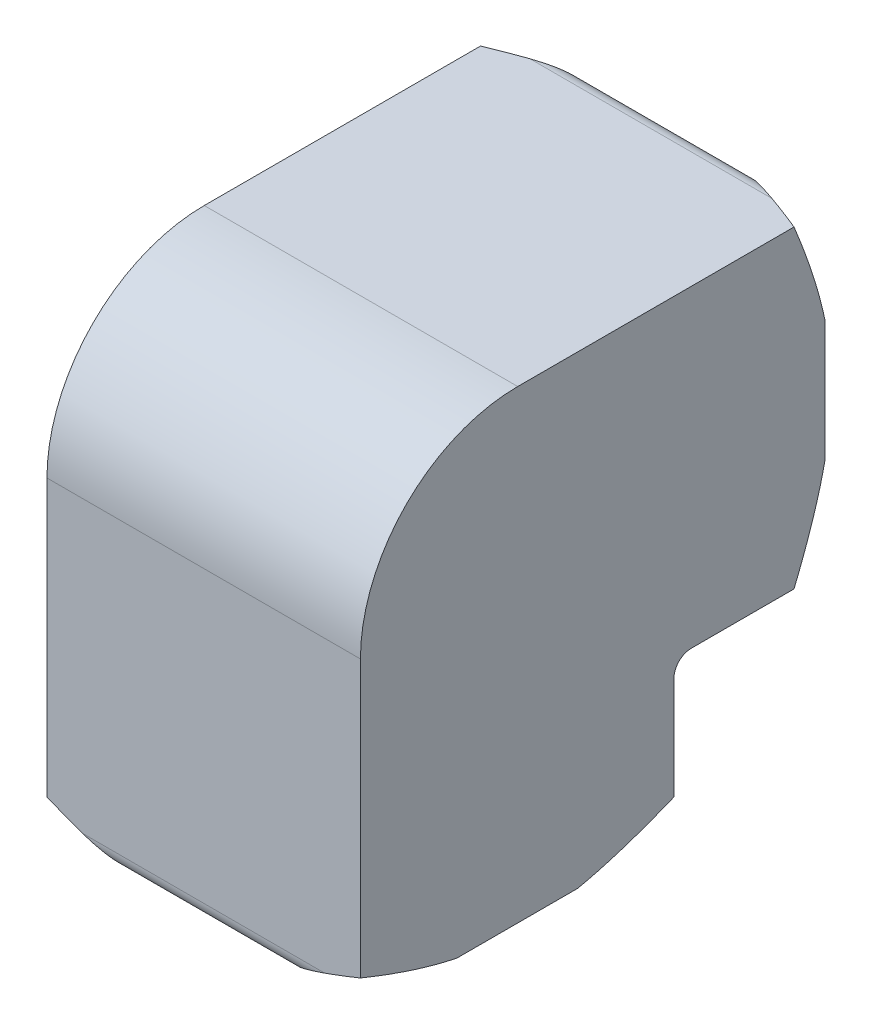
ISO-10303-21;
HEADER;
FILE_DESCRIPTION(('STEP AP214'),'2;1');
FILE_NAME('part.step','',(''),(''),'','','');
FILE_SCHEMA(('AUTOMOTIVE_DESIGN { 1 0 10303 214 1 1 1 1 }'));
ENDSEC;
DATA;
#1=APPLICATION_CONTEXT('core data for automotive mechanical design processes');
#2=APPLICATION_PROTOCOL_DEFINITION('international standard','automotive_design',2000,#1);
#3=PRODUCT_CONTEXT('',#1,'mechanical');
#4=PRODUCT('Part','Part','',(#3));
#5=PRODUCT_RELATED_PRODUCT_CATEGORY('part','',(#4));
#6=PRODUCT_DEFINITION_FORMATION('','',#4);
#7=PRODUCT_DEFINITION_CONTEXT('part definition',#1,'design');
#8=PRODUCT_DEFINITION('design','',#6,#7);
#9=PRODUCT_DEFINITION_SHAPE('','',#8);
#10=(LENGTH_UNIT() NAMED_UNIT(*) SI_UNIT(.MILLI.,.METRE.));
#11=(NAMED_UNIT(*) PLANE_ANGLE_UNIT() SI_UNIT($,.RADIAN.));
#12=(NAMED_UNIT(*) SI_UNIT($,.STERADIAN.) SOLID_ANGLE_UNIT());
#13=UNCERTAINTY_MEASURE_WITH_UNIT(LENGTH_MEASURE(1.E-05),#10,'distance_accuracy_value','');
#14=(GEOMETRIC_REPRESENTATION_CONTEXT(3) GLOBAL_UNCERTAINTY_ASSIGNED_CONTEXT((#13)) GLOBAL_UNIT_ASSIGNED_CONTEXT((#10,
#11,#12)) REPRESENTATION_CONTEXT('',''));
#15=CARTESIAN_POINT('',(0.,0.,0.));
#16=DIRECTION('',(0.,0.,1.));
#17=DIRECTION('',(1.,0.,0.));
#18=AXIS2_PLACEMENT_3D('',#15,#16,#17);
#19=CARTESIAN_POINT('',(0.,0.254000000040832,0.));
#20=DIRECTION('',(0.,-1.,0.));
#21=DIRECTION('',(0.,0.,-1.));
#22=AXIS2_PLACEMENT_3D('',#19,#20,#21);
#23=CONICAL_SURFACE('',#22,4.30529999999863,1.08210413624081);
#24=CARTESIAN_POINT('',(0.,0.254000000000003,0.));
#25=DIRECTION('',(0.,1.,0.));
#26=DIRECTION('',(-1.,0.,0.));
#27=AXIS2_PLACEMENT_3D('',#24,#25,#26);
#28=CIRCLE('',#27,4.3053);
#29=CARTESIAN_POINT('',(4.29780084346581,0.254000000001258,0.253999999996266));
#30=VERTEX_POINT('',#29);
#31=CARTESIAN_POINT('',(-4.29780084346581,0.254000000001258,0.253999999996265));
#32=VERTEX_POINT('',#31);
#33=EDGE_CURVE('E390',#30,#32,#28,.F.);
#34=ORIENTED_EDGE('',*,*,#33,.T.);
#35=CARTESIAN_POINT('',(-4.29780084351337,0.254000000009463,0.253999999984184));
#36=CARTESIAN_POINT('',(-4.17394440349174,0.317726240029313,0.31774207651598));
#37=CARTESIAN_POINT('',(-4.04959262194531,0.380821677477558,0.3811848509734));
#38=CARTESIAN_POINT('',(-3.80671815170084,0.501866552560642,0.503048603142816));
#39=CARTESIAN_POINT('',(-3.68827697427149,0.559901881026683,0.56154707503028));
#40=CARTESIAN_POINT('',(-3.45716436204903,0.670839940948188,0.673094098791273));
#41=CARTESIAN_POINT('',(-3.34459305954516,0.72383720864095,0.726255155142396));
#42=CARTESIAN_POINT('',(-3.12524135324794,0.824680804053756,0.826998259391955));
#43=CARTESIAN_POINT('',(-3.01857342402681,0.872635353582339,0.874716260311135));
#44=CARTESIAN_POINT('',(-2.81106172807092,0.963394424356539,0.964688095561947));
#45=CARTESIAN_POINT('',(-2.710337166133,1.00632373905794,1.00709003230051));
#46=CARTESIAN_POINT('',(-2.51476036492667,1.08696906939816,1.08698037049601));
#47=CARTESIAN_POINT('',(-2.42002387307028,1.12483594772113,1.12460037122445));
#48=CARTESIAN_POINT('',(-2.19785445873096,1.21022098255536,1.20998262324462));
#49=CARTESIAN_POINT('',(-2.06981356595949,1.25686999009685,1.25706163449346));
#50=CARTESIAN_POINT('',(-1.87837706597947,1.32202747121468,1.32246037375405));
#51=CARTESIAN_POINT('',(-1.81635291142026,1.34244643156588,1.34289695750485));
#52=CARTESIAN_POINT('',(-1.6935460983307,1.38133141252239,1.3817636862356));
#53=CARTESIAN_POINT('',(-1.63279094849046,1.39983983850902,1.40023799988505));
#54=CARTESIAN_POINT('',(-1.51241141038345,1.43491545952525,1.43518517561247));
#55=CARTESIAN_POINT('',(-1.45281271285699,1.45152572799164,1.45170306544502));
#56=CARTESIAN_POINT('',(-1.3346078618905,1.48277333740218,1.48286618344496));
#57=CARTESIAN_POINT('',(-1.27602405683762,1.49745433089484,1.49755219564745));
#58=CARTESIAN_POINT('',(-1.14828084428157,1.52762767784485,1.52755941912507));
#59=CARTESIAN_POINT('',(-1.07898505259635,1.54284795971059,1.54257908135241));
#60=CARTESIAN_POINT('',(-0.941885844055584,1.5704685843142,1.56956991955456));
#61=CARTESIAN_POINT('',(-0.874116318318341,1.58294961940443,1.58163012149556));
#62=CARTESIAN_POINT('',(-0.739537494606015,1.60506756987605,1.60311485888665));
#63=CARTESIAN_POINT('',(-0.67274858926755,1.61476960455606,1.61259941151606));
#64=CARTESIAN_POINT('',(-0.53944681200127,1.63135835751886,1.62910099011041));
#65=CARTESIAN_POINT('',(-0.472942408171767,1.63828135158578,1.63614963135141));
#66=CARTESIAN_POINT('',(-0.339400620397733,1.64934164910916,1.64775656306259));
#67=CARTESIAN_POINT('',(-0.272362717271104,1.65347578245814,1.65231201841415));
#68=CARTESIAN_POINT('',(-0.171263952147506,1.65760277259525,1.65702539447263));
#69=CARTESIAN_POINT('',(-0.137289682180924,1.65863257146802,1.65824394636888));
#70=CARTESIAN_POINT('',(-0.0688772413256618,1.66000963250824,1.65990818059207));
#71=CARTESIAN_POINT('',(-0.0344386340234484,1.66034810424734,1.66034390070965));
#72=CARTESIAN_POINT('',(0.0344606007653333,1.66034518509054,1.66034939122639));
#73=CARTESIAN_POINT('',(0.068921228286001,1.66000336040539,1.65991860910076));
#74=CARTESIAN_POINT('',(0.137374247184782,1.6586204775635,1.65826013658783));
#75=CARTESIAN_POINT('',(0.17136707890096,1.65758826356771,1.65704253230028));
#76=CARTESIAN_POINT('',(0.272510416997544,1.65345491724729,1.65232844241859));
#77=CARTESIAN_POINT('',(0.339574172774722,1.64931767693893,1.64776783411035));
#78=CARTESIAN_POINT('',(0.473151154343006,1.63825290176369,1.63614533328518));
#79=CARTESIAN_POINT('',(0.539665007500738,1.63132918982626,1.62908686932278));
#80=CARTESIAN_POINT('',(0.672968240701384,1.61474044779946,1.6125668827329));
#81=CARTESIAN_POINT('',(0.739749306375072,1.60503982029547,1.60307433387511));
#82=CARTESIAN_POINT('',(0.874294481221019,1.58292661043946,1.58158003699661));
#83=CARTESIAN_POINT('',(0.942038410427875,1.57044955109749,1.56951898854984));
#84=CARTESIAN_POINT('',(1.07906918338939,1.5428371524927,1.54254320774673));
#85=CARTESIAN_POINT('',(1.1483224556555,1.52762159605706,1.52754059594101));
#86=CARTESIAN_POINT('',(1.27605969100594,1.4974426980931,1.49755159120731));
#87=CARTESIAN_POINT('',(1.33467888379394,1.4827492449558,1.48286425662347));
#88=CARTESIAN_POINT('',(1.4529407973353,1.45148225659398,1.45169111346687));
#89=CARTESIAN_POINT('',(1.51256126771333,1.43486546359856,1.43516449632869));
#90=CARTESIAN_POINT('',(1.63297004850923,1.39978076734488,1.40020011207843));
#91=CARTESIAN_POINT('',(1.69373281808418,1.38127010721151,1.38171752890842));
#92=CARTESIAN_POINT('',(1.81653978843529,1.34238531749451,1.34283728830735));
#93=CARTESIAN_POINT('',(1.8785566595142,1.32196909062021,1.32239573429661));
#94=CARTESIAN_POINT('',(2.06992527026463,1.25683356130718,1.25700546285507));
#95=CARTESIAN_POINT('',(2.19790865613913,1.2102027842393,1.20995057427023));
#96=CARTESIAN_POINT('',(2.42004618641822,1.12482538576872,1.12460026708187));
#97=CARTESIAN_POINT('',(2.5148058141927,1.08694640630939,1.08698348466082));
#98=CARTESIAN_POINT('',(2.71041917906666,1.00628249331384,1.00709193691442));
#99=CARTESIAN_POINT('',(2.81115704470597,0.963347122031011,0.964684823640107));
#100=CARTESIAN_POINT('',(3.01868643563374,0.872579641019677,0.874703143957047));
#101=CARTESIAN_POINT('',(3.12535880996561,0.824622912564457,0.826980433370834));
#102=CARTESIAN_POINT('',(3.34470996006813,0.723779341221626,0.726229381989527));
#103=CARTESIAN_POINT('',(3.45727633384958,0.670784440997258,0.673065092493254));
#104=CARTESIAN_POINT('',(3.68837006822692,0.559855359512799,0.561516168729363));
#105=CARTESIAN_POINT('',(3.80679742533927,0.501826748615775,0.503019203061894));
#106=CARTESIAN_POINT('',(4.04963581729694,0.380799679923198,0.381165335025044));
#107=CARTESIAN_POINT('',(4.17396550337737,0.317715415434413,0.317731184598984));
#108=CARTESIAN_POINT('',(4.29780084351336,0.254000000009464,0.253999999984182));
#109=B_SPLINE_CURVE_WITH_KNOTS('',3,(#35,#36,#37,#38,#39,#40,#41,#42,#43,#44,#45,#46,#47,#48,
#49,#50,#51,#52,#53,#54,#55,#56,#57,#58,#59,#60,#61,#62,#63,#64,#65,#66,#67,#68,#69,#70,#71,#72,
#73,#74,#75,#76,#77,#78,#79,#80,#81,#82,#83,#84,#85,#86,#87,#88,#89,#90,#91,#92,#93,#94,#95,#96,
#97,#98,#99,#100,#101,#102,#103,#104,#105,#106,#107,#108),.UNSPECIFIED.,.F.,.F.,(4,2,2,2,2,2,2,
2,2,2,2,2,2,2,2,2,2,2,2,2,2,2,2,2,2,2,2,2,2,2,2,2,2,2,2,2,4),(0.,0.459562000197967,
0.892401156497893,1.29828008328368,1.6771790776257,2.02938041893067,2.35556838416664,
2.78790083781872,2.99314139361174,3.19154228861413,3.38361875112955,3.57004706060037,
3.78752358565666,3.99730893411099,4.20167715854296,4.40328343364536,4.60511849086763,
4.7071403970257,4.81045166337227,4.9138288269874,5.0159064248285,5.21782006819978,
5.41945763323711,5.62380558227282,5.83351511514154,6.05085656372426,6.23739453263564,
6.42954349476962,6.62797415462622,6.83319694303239,7.26533573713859,7.59159337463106,
7.94384107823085,8.32275912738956,8.72862676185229,9.16142197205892,9.62090568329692),.UNSPECIFIED.);
#110=EDGE_CURVE('E336',#32,#30,#109,.T.);
#111=ORIENTED_EDGE('',*,*,#110,.T.);
#112=EDGE_LOOP('',(#34,#111));
#113=FACE_BOUND('',#112,.T.);
#114=ADVANCED_FACE('F17',(#113),#23,.F.);
#115=CARTESIAN_POINT('',(0.,0.,-9.83614999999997));
#116=DIRECTION('',(0.,0.,1.));
#117=DIRECTION('',(1.,0.,0.));
#118=AXIS2_PLACEMENT_3D('',#115,#116,#117);
#119=CYLINDRICAL_SURFACE('',#118,4.3053);
#120=CARTESIAN_POINT('',(-4.30529999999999,2.50147572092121E-07,2.50002319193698E-07));
#121=CARTESIAN_POINT('',(-4.30530000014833,0.0105897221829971,0.0105835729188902));
#122=CARTESIAN_POINT('',(-4.3052609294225,0.0211791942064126,0.0211668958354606));
#123=CARTESIAN_POINT('',(-4.30510465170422,0.0423575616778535,0.0423335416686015));
#124=CARTESIAN_POINT('',(-4.30498744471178,0.0529464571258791,0.052916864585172));
#125=CARTESIAN_POINT('',(-4.304674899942,0.0741230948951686,0.074083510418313));
#126=CARTESIAN_POINT('',(-4.30447956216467,0.0847108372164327,0.0846668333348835));
#127=CARTESIAN_POINT('',(-4.30401076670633,0.105884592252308,0.105833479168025));
#128=CARTESIAN_POINT('',(-4.30373730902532,0.11647060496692,0.116416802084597));
#129=CARTESIAN_POINT('',(-4.30311228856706,0.137640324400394,0.137583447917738));
#130=CARTESIAN_POINT('',(-4.30276072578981,0.148224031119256,0.148166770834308));
#131=CARTESIAN_POINT('',(-4.30197951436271,0.169388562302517,0.169333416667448));
#132=CARTESIAN_POINT('',(-4.30154986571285,0.179969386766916,0.179916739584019));
#133=CARTESIAN_POINT('',(-4.30061250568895,0.20112757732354,0.20108338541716));
#134=CARTESIAN_POINT('',(-4.3001047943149,0.211704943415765,0.211666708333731));
#135=CARTESIAN_POINT('',(-4.29901133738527,0.232855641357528,0.232833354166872));
#136=CARTESIAN_POINT('',(-4.2984255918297,0.243428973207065,0.243416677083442));
#137=CARTESIAN_POINT('',(-4.29780084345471,0.254000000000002,0.254000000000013));
#138=B_SPLINE_CURVE_WITH_KNOTS('',3,(#120,#121,#122,#123,#124,#125,#126,#127,#128,#129,#130,
#131,#132,#133,#134,#135,#136,#137),.UNSPECIFIED.,.F.,.F.,(4,2,2,2,2,2,2,2,4),(0.,
0.0449142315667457,0.0898284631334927,0.134742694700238,0.179656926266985,0.22457115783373,
0.269485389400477,0.314399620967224,0.359313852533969),.UNSPECIFIED.);
#139=CARTESIAN_POINT('',(-4.3053,9.37871823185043E-08,9.3769027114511E-08));
#140=VERTEX_POINT('',#139);
#141=EDGE_CURVE('E347',#140,#32,#138,.T.);
#142=ORIENTED_EDGE('',*,*,#141,.T.);
#143=CARTESIAN_POINT('',(0.,0.,0.254000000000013));
#144=DIRECTION('',(0.,0.,1.));
#145=DIRECTION('',(-0.998258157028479,0.0589970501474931,0.));
#146=AXIS2_PLACEMENT_3D('',#143,#144,#145);
#147=CIRCLE('',#146,4.3053);
#148=CARTESIAN_POINT('',(-4.29780084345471,-0.254000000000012,0.254000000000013));
#149=VERTEX_POINT('',#148);
#150=EDGE_CURVE('E386',#32,#149,#147,.T.);
#151=ORIENTED_EDGE('',*,*,#150,.T.);
#152=CARTESIAN_POINT('',(-4.29780084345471,-0.254000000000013,0.254000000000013));
#153=CARTESIAN_POINT('',(-4.29842559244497,-0.243428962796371,0.243416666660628));
#154=CARTESIAN_POINT('',(-4.299011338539,-0.232855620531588,0.232833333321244));
#155=CARTESIAN_POINT('',(-4.30010479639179,-0.211704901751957,0.211666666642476));
#156=CARTESIAN_POINT('',(-4.30061250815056,-0.201127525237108,0.201083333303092));
#157=CARTESIAN_POINT('',(-4.3015498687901,-0.179969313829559,0.179916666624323));
#158=CARTESIAN_POINT('',(-4.30197951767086,-0.169388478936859,0.169333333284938));
#159=CARTESIAN_POINT('',(-4.30276072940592,-0.148223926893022,0.148166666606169));
#160=CARTESIAN_POINT('',(-4.30311229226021,-0.137640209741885,0.137583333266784));
#161=CARTESIAN_POINT('',(-4.30373731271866,-0.116470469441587,0.116416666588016));
#162=CARTESIAN_POINT('',(-4.3040107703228,-0.105884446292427,0.105833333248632));
#163=CARTESIAN_POINT('',(-4.30447956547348,-0.0847106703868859,0.0846666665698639));
#164=CARTESIAN_POINT('',(-4.30467490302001,-0.0741229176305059,0.0740833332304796));
#165=CARTESIAN_POINT('',(-4.30498744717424,-0.052946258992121,0.052916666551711));
#166=CARTESIAN_POINT('',(-4.30510465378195,-0.0423573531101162,0.0423333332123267));
#167=CARTESIAN_POINT('',(-4.30526093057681,-0.0211789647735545,0.0211666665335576));
#168=CARTESIAN_POINT('',(-4.30530000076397,-0.0105894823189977,0.0105833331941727));
#169=CARTESIAN_POINT('',(-4.3053,1.45298200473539E-10,-1.45211967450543E-10));
#170=B_SPLINE_CURVE_WITH_KNOTS('',3,(#152,#153,#154,#155,#156,#157,#158,#159,#160,#161,#162,
#163,#164,#165,#166,#167,#168,#169),.UNSPECIFIED.,.F.,.F.,(4,2,2,2,2,2,2,2,4),(0.,
0.0449142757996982,0.0898285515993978,0.134742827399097,0.179657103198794,0.224571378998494,
0.269485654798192,0.314399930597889,0.359314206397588),.UNSPECIFIED.);
#171=EDGE_CURVE('E383',#149,#140,#170,.T.);
#172=ORIENTED_EDGE('',*,*,#171,.T.);
#173=EDGE_LOOP('',(#142,#151,#172));
#174=FACE_BOUND('',#173,.T.);
#175=ADVANCED_FACE('F406',(#174),#119,.F.);
#176=CARTESIAN_POINT('',(0.,0.,-9.83614999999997));
#177=DIRECTION('',(0.,0.,1.));
#178=DIRECTION('',(1.,0.,0.));
#179=AXIS2_PLACEMENT_3D('',#176,#177,#178);
#180=CYLINDRICAL_SURFACE('',#179,4.3053);
#181=CARTESIAN_POINT('',(0.,0.,0.254000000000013));
#182=DIRECTION('',(0.,0.,1.));
#183=DIRECTION('',(0.998258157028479,-0.0589970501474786,0.));
#184=AXIS2_PLACEMENT_3D('',#181,#182,#183);
#185=CIRCLE('',#184,4.3053);
#186=CARTESIAN_POINT('',(4.29780084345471,-0.253999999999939,0.254000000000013));
#187=VERTEX_POINT('',#186);
#188=EDGE_CURVE('E376',#187,#30,#185,.T.);
#189=ORIENTED_EDGE('',*,*,#188,.T.);
#190=CARTESIAN_POINT('',(4.29780084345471,0.254000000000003,0.254000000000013));
#191=CARTESIAN_POINT('',(4.2984255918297,0.243428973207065,0.243416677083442));
#192=CARTESIAN_POINT('',(4.29901133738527,0.232855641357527,0.232833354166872));
#193=CARTESIAN_POINT('',(4.30010479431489,0.211704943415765,0.211666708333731));
#194=CARTESIAN_POINT('',(4.30061250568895,0.20112757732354,0.20108338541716));
#195=CARTESIAN_POINT('',(4.30154986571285,0.179969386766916,0.179916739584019));
#196=CARTESIAN_POINT('',(4.3019795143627,0.169388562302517,0.169333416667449));
#197=CARTESIAN_POINT('',(4.30276072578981,0.148224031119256,0.148166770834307));
#198=CARTESIAN_POINT('',(4.30311228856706,0.137640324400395,0.137583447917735));
#199=CARTESIAN_POINT('',(4.30373730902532,0.11647060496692,0.116416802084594));
#200=CARTESIAN_POINT('',(4.30401076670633,0.105884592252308,0.105833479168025));
#201=CARTESIAN_POINT('',(4.30447956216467,0.0847108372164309,0.0846668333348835));
#202=CARTESIAN_POINT('',(4.304674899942,0.0741230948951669,0.074083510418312));
#203=CARTESIAN_POINT('',(4.30498744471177,0.0529464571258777,0.0529168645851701));
#204=CARTESIAN_POINT('',(4.30510465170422,0.0423575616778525,0.0423335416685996));
#205=CARTESIAN_POINT('',(4.3052609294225,0.0211791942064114,0.0211668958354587));
#206=CARTESIAN_POINT('',(4.30530000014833,0.0105897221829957,0.0105835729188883));
#207=CARTESIAN_POINT('',(4.30529999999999,2.50147570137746E-07,2.50002317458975E-07));
#208=B_SPLINE_CURVE_WITH_KNOTS('',3,(#190,#191,#192,#193,#194,#195,#196,#197,#198,#199,#200,
#201,#202,#203,#204,#205,#206,#207),.UNSPECIFIED.,.F.,.F.,(4,2,2,2,2,2,2,2,4),(0.,
0.0449142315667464,0.0898284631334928,0.134742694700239,0.179656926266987,0.224571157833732,
0.26948538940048,0.314399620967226,0.359313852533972),.UNSPECIFIED.);
#209=CARTESIAN_POINT('',(4.3053,6.25187351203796E-08,-1.81531147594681E-11));
#210=VERTEX_POINT('',#209);
#211=EDGE_CURVE('E394',#30,#210,#208,.T.);
#212=ORIENTED_EDGE('',*,*,#211,.T.);
#213=CARTESIAN_POINT('',(4.3053,0.,0.));
#214=CARTESIAN_POINT('',(4.30530000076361,-0.010589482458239,0.0105833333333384));
#215=CARTESIAN_POINT('',(4.30526093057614,-0.0211789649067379,0.0211666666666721));
#216=CARTESIAN_POINT('',(4.30510465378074,-0.0423573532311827,0.0423333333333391));
#217=CARTESIAN_POINT('',(4.30498744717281,-0.0529462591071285,0.0529166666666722));
#218=CARTESIAN_POINT('',(4.30467490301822,-0.0741229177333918,0.0740833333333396));
#219=CARTESIAN_POINT('',(4.30447956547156,-0.0847106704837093,0.0846666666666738));
#220=CARTESIAN_POINT('',(4.3040107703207,-0.105884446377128,0.105833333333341));
#221=CARTESIAN_POINT('',(4.30373731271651,-0.11647046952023,0.116416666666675));
#222=CARTESIAN_POINT('',(4.30311229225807,-0.137640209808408,0.137583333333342));
#223=CARTESIAN_POINT('',(4.30276072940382,-0.148223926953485,0.148166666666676));
#224=CARTESIAN_POINT('',(4.30197951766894,-0.169388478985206,0.169333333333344));
#225=CARTESIAN_POINT('',(4.30154986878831,-0.179969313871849,0.179916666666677));
#226=CARTESIAN_POINT('',(4.30061250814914,-0.201127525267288,0.201083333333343));
#227=CARTESIAN_POINT('',(4.30010479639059,-0.211704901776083,0.211666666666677));
#228=CARTESIAN_POINT('',(4.29901133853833,-0.232855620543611,0.232833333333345));
#229=CARTESIAN_POINT('',(4.29842559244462,-0.243428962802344,0.243416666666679));
#230=CARTESIAN_POINT('',(4.29780084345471,-0.25399999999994,0.254000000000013));
#231=B_SPLINE_CURVE_WITH_KNOTS('',3,(#213,#214,#215,#216,#217,#218,#219,#220,#221,#222,#223,
#224,#225,#226,#227,#228,#229,#230),.UNSPECIFIED.,.F.,.F.,(4,2,2,2,2,2,2,2,4),(0.,
0.0449142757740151,0.0898285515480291,0.13474282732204,0.179657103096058,0.224571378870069,
0.269485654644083,0.314399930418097,0.359314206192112),.UNSPECIFIED.);
#232=EDGE_CURVE('E377',#210,#187,#231,.T.);
#233=ORIENTED_EDGE('',*,*,#232,.T.);
#234=EDGE_LOOP('',(#189,#212,#233));
#235=FACE_BOUND('',#234,.T.);
#236=ADVANCED_FACE('F408',(#235),#180,.F.);
#237=CARTESIAN_POINT('',(0.,-6.28015,0.));
#238=DIRECTION('',(0.,1.,0.));
#239=DIRECTION('',(0.,0.,1.));
#240=AXIS2_PLACEMENT_3D('',#237,#238,#239);
#241=CYLINDRICAL_SURFACE('',#240,4.3053);
#242=CARTESIAN_POINT('',(0.,0.254000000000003,0.));
#243=DIRECTION('',(0.,1.,0.));
#244=DIRECTION('',(-0.998258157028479,0.,-0.0589970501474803));
#245=AXIS2_PLACEMENT_3D('',#242,#243,#244);
#246=CIRCLE('',#245,4.3053);
#247=CARTESIAN_POINT('',(-4.29780084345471,0.254000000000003,-0.253999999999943));
#248=VERTEX_POINT('',#247);
#249=EDGE_CURVE('E366',#248,#32,#246,.T.);
#250=ORIENTED_EDGE('',*,*,#249,.T.);
#251=ORIENTED_EDGE('',*,*,#141,.F.);
#252=CARTESIAN_POINT('',(-4.3053,0.,0.));
#253=CARTESIAN_POINT('',(-4.30530000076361,0.0105833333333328,-0.0105894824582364));
#254=CARTESIAN_POINT('',(-4.30526093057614,0.0211666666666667,-0.0211789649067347));
#255=CARTESIAN_POINT('',(-4.30510465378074,0.0423333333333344,-0.0423573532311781));
#256=CARTESIAN_POINT('',(-4.30498744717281,0.0529166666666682,-0.0529462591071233));
#257=CARTESIAN_POINT('',(-4.30467490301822,0.0740833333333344,-0.0741229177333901));
#258=CARTESIAN_POINT('',(-4.30447956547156,0.0846666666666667,-0.0847106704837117));
#259=CARTESIAN_POINT('',(-4.3040107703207,0.105833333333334,-0.10588444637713));
#260=CARTESIAN_POINT('',(-4.30373731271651,0.116416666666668,-0.116470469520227));
#261=CARTESIAN_POINT('',(-4.30311229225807,0.137583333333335,-0.137640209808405));
#262=CARTESIAN_POINT('',(-4.30276072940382,0.148166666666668,-0.148223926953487));
#263=CARTESIAN_POINT('',(-4.30197951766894,0.169333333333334,-0.169388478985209));
#264=CARTESIAN_POINT('',(-4.30154986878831,0.179916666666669,-0.17996931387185));
#265=CARTESIAN_POINT('',(-4.30061250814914,0.201083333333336,-0.201127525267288));
#266=CARTESIAN_POINT('',(-4.30010479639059,0.211666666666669,-0.211704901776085));
#267=CARTESIAN_POINT('',(-4.29901133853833,0.232833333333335,-0.232855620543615));
#268=CARTESIAN_POINT('',(-4.29842559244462,0.243416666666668,-0.243428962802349));
#269=CARTESIAN_POINT('',(-4.29780084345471,0.254000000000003,-0.253999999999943));
#270=B_SPLINE_CURVE_WITH_KNOTS('',3,(#252,#253,#254,#255,#256,#257,#258,#259,#260,#261,#262,
#263,#264,#265,#266,#267,#268,#269),.UNSPECIFIED.,.F.,.F.,(4,2,2,2,2,2,2,2,4),(0.,
0.0449142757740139,0.0898285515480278,0.134742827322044,0.179657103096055,0.224571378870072,
0.269485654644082,0.314399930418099,0.359314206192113),.UNSPECIFIED.);
#271=EDGE_CURVE('E267',#140,#248,#270,.T.);
#272=ORIENTED_EDGE('',*,*,#271,.T.);
#273=EDGE_LOOP('',(#250,#251,#272));
#274=FACE_BOUND('',#273,.T.);
#275=ADVANCED_FACE('F315',(#274),#241,.F.);
#276=CARTESIAN_POINT('',(0.,0.,0.254000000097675));
#277=DIRECTION('',(0.,0.,-1.));
#278=DIRECTION('',(0.,1.,0.));
#279=AXIS2_PLACEMENT_3D('',#276,#277,#278);
#280=CONICAL_SURFACE('',#279,4.3052999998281,1.08210413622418);
#281=CARTESIAN_POINT('',(0.,0.,0.254000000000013));
#282=DIRECTION('',(0.,0.,1.));
#283=DIRECTION('',(1.,0.,0.));
#284=AXIS2_PLACEMENT_3D('',#281,#282,#283);
#285=CIRCLE('',#284,4.3053);
#286=EDGE_CURVE('E369',#32,#30,#285,.F.);
#287=ORIENTED_EDGE('',*,*,#286,.T.);
#288=ORIENTED_EDGE('',*,*,#110,.F.);
#289=EDGE_LOOP('',(#287,#288));
#290=FACE_BOUND('',#289,.T.);
#291=ADVANCED_FACE('F310',(#290),#280,.F.);
#292=CARTESIAN_POINT('',(0.,-6.28015,0.));
#293=DIRECTION('',(0.,1.,0.));
#294=DIRECTION('',(0.,0.,1.));
#295=AXIS2_PLACEMENT_3D('',#292,#293,#294);
#296=CYLINDRICAL_SURFACE('',#295,4.3053);
#297=CARTESIAN_POINT('',(0.,0.254000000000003,0.));
#298=DIRECTION('',(0.,1.,0.));
#299=DIRECTION('',(0.998258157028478,0.,0.0589970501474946));
#300=AXIS2_PLACEMENT_3D('',#297,#298,#299);
#301=CIRCLE('',#300,4.3053);
#302=CARTESIAN_POINT('',(4.29780084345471,0.254000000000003,-0.253999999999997));
#303=VERTEX_POINT('',#302);
#304=EDGE_CURVE('E213',#30,#303,#301,.T.);
#305=ORIENTED_EDGE('',*,*,#304,.T.);
#306=CARTESIAN_POINT('',(4.29780084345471,0.254000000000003,-0.253999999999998));
#307=CARTESIAN_POINT('',(4.2984255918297,0.243416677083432,-0.24342897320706));
#308=CARTESIAN_POINT('',(4.29901133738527,0.232833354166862,-0.232855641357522));
#309=CARTESIAN_POINT('',(4.3001047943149,0.211666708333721,-0.21170494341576));
#310=CARTESIAN_POINT('',(4.30061250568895,0.20108338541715,-0.201127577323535));
#311=CARTESIAN_POINT('',(4.30154986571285,0.17991673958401,-0.179969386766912));
#312=CARTESIAN_POINT('',(4.3019795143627,0.169333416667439,-0.169388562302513));
#313=CARTESIAN_POINT('',(4.30276072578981,0.148166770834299,-0.148224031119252));
#314=CARTESIAN_POINT('',(4.30311228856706,0.137583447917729,-0.137640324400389));
#315=CARTESIAN_POINT('',(4.30373730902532,0.116416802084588,-0.116470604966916));
#316=CARTESIAN_POINT('',(4.30401076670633,0.105833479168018,-0.105884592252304));
#317=CARTESIAN_POINT('',(4.30447956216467,0.084666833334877,-0.0847108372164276));
#318=CARTESIAN_POINT('',(4.304674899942,0.0740835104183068,-0.0741230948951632));
#319=CARTESIAN_POINT('',(4.30498744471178,0.0529168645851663,-0.0529464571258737));
#320=CARTESIAN_POINT('',(4.30510465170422,0.042333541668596,-0.0423575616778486));
#321=CARTESIAN_POINT('',(4.3052609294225,0.0211668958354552,-0.0211791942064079));
#322=CARTESIAN_POINT('',(4.30530000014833,0.0105835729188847,-0.0105897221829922));
#323=CARTESIAN_POINT('',(4.30529999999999,2.50002313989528E-07,-2.50147566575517E-07));
#324=B_SPLINE_CURVE_WITH_KNOTS('',3,(#306,#307,#308,#309,#310,#311,#312,#313,#314,#315,#316,
#317,#318,#319,#320,#321,#322,#323),.UNSPECIFIED.,.F.,.F.,(4,2,2,2,2,2,2,2,4),(0.,
0.0449142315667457,0.089828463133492,0.134742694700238,0.179656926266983,0.224571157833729,
0.269485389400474,0.31439962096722,0.359313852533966),.UNSPECIFIED.);
#325=EDGE_CURVE('E282',#303,#210,#324,.T.);
#326=ORIENTED_EDGE('',*,*,#325,.T.);
#327=ORIENTED_EDGE('',*,*,#211,.F.);
#328=EDGE_LOOP('',(#305,#326,#327));
#329=FACE_BOUND('',#328,.T.);
#330=ADVANCED_FACE('F301',(#329),#296,.F.);
#331=CARTESIAN_POINT('',(0.,-9.83615,0.));
#332=DIRECTION('',(0.,1.,0.));
#333=DIRECTION('',(-1.,0.,0.));
#334=AXIS2_PLACEMENT_3D('',#331,#332,#333);
#335=CYLINDRICAL_SURFACE('',#334,4.3053);
#336=CARTESIAN_POINT('',(0.,-12.2355733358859,0.));
#337=DIRECTION('',(0.,-1.,0.));
#338=DIRECTION('',(0.,0.,-1.));
#339=AXIS2_PLACEMENT_3D('',#336,#337,#338);
#340=CIRCLE('',#339,4.30529999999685);
#341=CARTESIAN_POINT('',(0.,-12.2355733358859,-4.30529999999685));
#342=VERTEX_POINT('',#341);
#343=EDGE_CURVE('E208',#342,#342,#340,.T.);
#344=ORIENTED_EDGE('',*,*,#343,.T.);
#345=EDGE_LOOP('',(#344));
#346=FACE_BOUND('',#345,.T.);
#347=ORIENTED_EDGE('',*,*,#232,.F.);
#348=CARTESIAN_POINT('',(4.3053,0.,0.));
#349=CARTESIAN_POINT('',(4.30528823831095,-0.125802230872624,-0.125962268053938));
#350=CARTESIAN_POINT('',(4.29977306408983,-0.251661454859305,-0.251885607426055));
#351=CARTESIAN_POINT('',(4.28013383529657,-0.474826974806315,-0.475037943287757));
#352=CARTESIAN_POINT('',(4.26821318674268,-0.572218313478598,-0.572380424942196));
#353=CARTESIAN_POINT('',(4.24694945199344,-0.707417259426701,-0.707467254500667));
#354=CARTESIAN_POINT('',(4.2404475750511,-0.745441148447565,-0.745454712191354));
#355=CARTESIAN_POINT('',(4.22240757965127,-0.842960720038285,-0.842939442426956));
#356=CARTESIAN_POINT('',(4.21010821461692,-0.902369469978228,-0.902383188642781));
#357=CARTESIAN_POINT('',(4.17121043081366,-1.0720381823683,-1.07212628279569));
#358=CARTESIAN_POINT('',(4.14142934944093,-1.18195757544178,-1.18206280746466));
#359=CARTESIAN_POINT('',(4.0912000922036,-1.34175296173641,-1.34182720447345));
#360=CARTESIAN_POINT('',(4.07432245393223,-1.39218933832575,-1.39224554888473));
#361=CARTESIAN_POINT('',(4.0395352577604,-1.49005464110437,-1.49007180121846));
#362=CARTESIAN_POINT('',(4.02172756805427,-1.53750147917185,-1.53749782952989));
#363=CARTESIAN_POINT('',(3.97952926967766,-1.64408361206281,-1.64408819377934));
#364=CARTESIAN_POINT('',(3.95461893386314,-1.70310937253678,-1.70315708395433));
#365=CARTESIAN_POINT('',(3.90265288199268,-1.81883759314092,-1.81901770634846));
#366=CARTESIAN_POINT('',(3.87567725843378,-1.87555869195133,-1.87582674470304));
#367=CARTESIAN_POINT('',(3.81977946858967,-1.98667984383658,-1.98712309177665));
#368=CARTESIAN_POINT('',(3.79093588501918,-2.04109965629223,-2.04163010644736));
#369=CARTESIAN_POINT('',(3.73149557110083,-2.14761609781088,-2.14829360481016));
#370=CARTESIAN_POINT('',(3.70097591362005,-2.19973383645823,-2.20047193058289));
#371=CARTESIAN_POINT('',(3.63837209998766,-2.3016449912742,-2.30246116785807));
#372=CARTESIAN_POINT('',(3.6063634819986,-2.35146095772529,-2.35229588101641));
#373=CARTESIAN_POINT('',(3.54096471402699,-2.44876697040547,-2.44959285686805));
#374=CARTESIAN_POINT('',(3.50764856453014,-2.49628115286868,-2.49708068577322));
#375=CARTESIAN_POINT('',(3.43981171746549,-2.58898210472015,-2.58968955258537));
#376=CARTESIAN_POINT('',(3.40536348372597,-2.63419473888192,-2.6348377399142));
#377=CARTESIAN_POINT('',(3.33543273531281,-2.72229030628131,-2.72278320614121));
#378=CARTESIAN_POINT('',(3.30002116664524,-2.76520101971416,-2.76560902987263));
#379=CARTESIAN_POINT('',(3.22832810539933,-2.8486924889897,-2.84893384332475));
#380=CARTESIAN_POINT('',(3.19211602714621,-2.88930305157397,-2.8894626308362));
#381=CARTESIAN_POINT('',(3.11897617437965,-2.96818596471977,-2.96822899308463));
#382=CARTESIAN_POINT('',(3.08211640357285,-3.00649061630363,-3.0064973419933));
#383=CARTESIAN_POINT('',(3.00150208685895,-3.08711906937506,-3.0871114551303));
#384=CARTESIAN_POINT('',(2.95747999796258,-3.12930528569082,-3.12932796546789));
#385=CARTESIAN_POINT('',(2.86803126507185,-3.21138255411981,-3.21148056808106));
#386=CARTESIAN_POINT('',(2.82266028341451,-3.25130408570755,-3.25144678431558));
#387=CARTESIAN_POINT('',(2.73063659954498,-3.32884494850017,-3.32907964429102));
#388=CARTESIAN_POINT('',(2.68403762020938,-3.36649614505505,-3.3667780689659));
#389=CARTESIAN_POINT('',(2.58968363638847,-3.43949656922,-3.43985828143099));
#390=CARTESIAN_POINT('',(2.54198012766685,-3.47487886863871,-3.47527345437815));
#391=CARTESIAN_POINT('',(2.44553978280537,-3.5433398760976,-3.54377772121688));
#392=CARTESIAN_POINT('',(2.39685204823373,-3.57645287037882,-3.57690160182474));
#393=CARTESIAN_POINT('',(2.2985641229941,-3.64037415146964,-3.6408197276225));
#394=CARTESIAN_POINT('',(2.24901043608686,-3.67121787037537,-3.67164997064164));
#395=CARTESIAN_POINT('',(2.1491090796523,-3.73059950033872,-3.73098326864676));
#396=CARTESIAN_POINT('',(2.09880511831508,-3.75917390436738,-3.75952330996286));
#397=CARTESIAN_POINT('',(1.99751901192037,-3.81401566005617,-3.81428436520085));
#398=CARTESIAN_POINT('',(1.94657758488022,-3.84032045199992,-3.84054310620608));
#399=CARTESIAN_POINT('',(1.84412999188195,-3.89062284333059,-3.89075497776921));
#400=CARTESIAN_POINT('',(1.79266135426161,-3.91465865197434,-3.9147463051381));
#401=CARTESIAN_POINT('',(1.68926826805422,-3.96041956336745,-3.9604425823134));
#402=CARTESIAN_POINT('',(1.63737801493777,-3.98218352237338,-3.98218588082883));
#403=CARTESIAN_POINT('',(1.53420245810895,-4.0230343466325,-4.02303208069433));
#404=CARTESIAN_POINT('',(1.48297327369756,-4.04219273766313,-4.04220510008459));
#405=CARTESIAN_POINT('',(1.37992910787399,-4.0784722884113,-4.07852287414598));
#406=CARTESIAN_POINT('',(1.32813058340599,-4.09561684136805,-4.09569090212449));
#407=CARTESIAN_POINT('',(1.22402910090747,-4.12786695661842,-4.12798915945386));
#408=CARTESIAN_POINT('',(1.17173997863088,-4.14299481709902,-4.14314166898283));
#409=CARTESIAN_POINT('',(1.06673945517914,-4.17121347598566,-4.17140236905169));
#410=CARTESIAN_POINT('',(1.01403933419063,-4.18432518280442,-4.18453154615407));
#411=CARTESIAN_POINT('',(0.908298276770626,-4.20851281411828,-4.20874259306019));
#412=CARTESIAN_POINT('',(0.855266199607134,-4.21960801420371,-4.21984385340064));
#413=CARTESIAN_POINT('',(0.74894217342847,-4.23976440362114,-4.2399994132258));
#414=CARTESIAN_POINT('',(0.695656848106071,-4.2488429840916,-4.24907121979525));
#415=CARTESIAN_POINT('',(0.588906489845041,-4.26496809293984,-4.26517152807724));
#416=CARTESIAN_POINT('',(0.535446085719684,-4.27202989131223,-4.27221538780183));
#417=CARTESIAN_POINT('',(0.428424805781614,-4.28412363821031,-4.28426668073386));
#418=CARTESIAN_POINT('',(0.374866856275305,-4.28916851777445,-4.28928708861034));
#419=CARTESIAN_POINT('',(0.267728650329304,-4.29723086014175,-4.29730149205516));
#420=CARTESIAN_POINT('',(0.214149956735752,-4.30025872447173,-4.30030588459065));
#421=CARTESIAN_POINT('',(0.107047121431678,-4.30428956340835,-4.30430130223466));
#422=CARTESIAN_POINT('',(0.0535235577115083,-4.30530025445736,-4.30529999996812));
#423=CARTESIAN_POINT('',(-0.0535267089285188,-4.30529974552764,-4.30530000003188));
#424=CARTESIAN_POINT('',(-0.107053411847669,-4.30428842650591,-4.30430118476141));
#425=CARTESIAN_POINT('',(-0.214161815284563,-4.30025653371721,-4.30030532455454));
#426=CARTESIAN_POINT('',(-0.267742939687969,-4.29722827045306,-4.29730063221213));
#427=CARTESIAN_POINT('',(-0.374885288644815,-4.28916519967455,-4.28928549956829));
#428=CARTESIAN_POINT('',(-0.428444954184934,-4.28412001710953,-4.28426468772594));
#429=CARTESIAN_POINT('',(-0.535468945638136,-4.2720257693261,-4.27221253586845));
#430=CARTESIAN_POINT('',(-0.588930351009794,-4.26496379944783,-4.26516824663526));
#431=CARTESIAN_POINT('',(-0.695681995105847,-4.24883844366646,-4.24906710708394));
#432=CARTESIAN_POINT('',(-0.748967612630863,-4.23975981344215,-4.23999492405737));
#433=CARTESIAN_POINT('',(-0.855291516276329,-4.21960342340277,-4.21983871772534));
#434=CARTESIAN_POINT('',(-0.908323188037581,-4.20850829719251,-4.20873721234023));
#435=CARTESIAN_POINT('',(-1.01406274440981,-4.18432091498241,-4.18452585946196));
#436=CARTESIAN_POINT('',(-1.06676178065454,-4.1712094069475,-4.17139664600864));
#437=CARTESIAN_POINT('',(-1.17175946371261,-4.14299124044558,-4.14313613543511));
#438=CARTESIAN_POINT('',(-1.22404684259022,-4.1278636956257,-4.12798387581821));
#439=CARTESIAN_POINT('',(-1.32814420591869,-4.09561433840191,-4.09568645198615));
#440=CARTESIAN_POINT('',(-1.3799403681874,-4.07847024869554,-4.07851903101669));
#441=CARTESIAN_POINT('',(-1.48297917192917,-4.04219163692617,-4.04220289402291));
#442=CARTESIAN_POINT('',(-1.53420537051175,-4.02303373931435,-4.02303092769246));
#443=CARTESIAN_POINT('',(-1.63738116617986,-3.98218170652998,-3.98218463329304));
#444=CARTESIAN_POINT('',(-1.68927447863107,-3.96041583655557,-3.96043998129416));
#445=CARTESIAN_POINT('',(-1.79267291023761,-3.91465157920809,-3.91474105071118));
#446=CARTESIAN_POINT('',(-1.84414385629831,-3.89061436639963,-3.89074844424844));
#447=CARTESIAN_POINT('',(-1.94659527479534,-3.84030952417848,-3.84053416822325));
#448=CARTESIAN_POINT('',(-1.99753824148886,-3.81400371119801,-3.81427432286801));
#449=CARTESIAN_POINT('',(-2.09882667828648,-3.75916030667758,-3.75951129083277));
#450=CARTESIAN_POINT('',(-2.14913145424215,-3.73058529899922,-3.7309703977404));
#451=CARTESIAN_POINT('',(-2.24903372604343,-3.67120284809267,-3.67163571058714));
#452=CARTESIAN_POINT('',(-2.29858753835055,-3.64035893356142,-3.64080495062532));
#453=CARTESIAN_POINT('',(-2.39687504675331,-3.57643765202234,-3.57688618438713));
#454=CARTESIAN_POINT('',(-2.44556226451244,-3.54332487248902,-3.5437622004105));
#455=CARTESIAN_POINT('',(-2.54200096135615,-3.47486468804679,-3.47525819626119));
#456=CARTESIAN_POINT('',(-2.58970336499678,-3.43948301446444,-3.43984340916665));
#457=CARTESIAN_POINT('',(-2.68405458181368,-3.3664842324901,-3.36676451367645));
#458=CARTESIAN_POINT('',(-2.73065192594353,-3.32883406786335,-3.3290670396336));
#459=CARTESIAN_POINT('',(-2.82267185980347,-3.25129568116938,-3.25143668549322));
#460=CARTESIAN_POINT('',(-2.8680407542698,-3.21137560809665,-3.21147204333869));
#461=CARTESIAN_POINT('',(-2.95748486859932,-3.12930159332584,-3.12932329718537));
#462=CARTESIAN_POINT('',(-3.0015044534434,-3.08711718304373,-3.08710908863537));
#463=CARTESIAN_POINT('',(-3.08211874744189,-3.00648784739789,-3.00649499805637));
#464=CARTESIAN_POINT('',(-3.11898074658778,-2.96818037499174,-2.9682242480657));
#465=CARTESIAN_POINT('',(-3.19212439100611,-2.88929247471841,-2.88945343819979));
#466=CARTESIAN_POINT('',(-3.22833806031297,-2.84867976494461,-2.84892261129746));
#467=CARTESIAN_POINT('',(-3.30003365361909,-2.76518458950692,-2.76559416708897));
#468=CARTESIAN_POINT('',(-3.33544619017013,-2.72227233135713,-2.72276676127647));
#469=CARTESIAN_POINT('',(-3.40537829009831,-2.634174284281,-2.63481862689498));
#470=CARTESIAN_POINT('',(-3.43982693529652,-2.58896072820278,-2.58966936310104));
#471=CARTESIAN_POINT('',(-3.50766408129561,-2.49625853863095,-2.49705889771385));
#472=CARTESIAN_POINT('',(-3.54098014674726,-2.44874405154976,-2.44957055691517));
#473=CARTESIAN_POINT('',(-3.60637829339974,-2.35143803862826,-2.35227316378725));
#474=CARTESIAN_POINT('',(-3.63838640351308,-2.30162238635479,-2.30243855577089));
#475=CARTESIAN_POINT('',(-3.70098882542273,-2.19971247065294,-2.20045018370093));
#476=CARTESIAN_POINT('',(-3.73150762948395,-2.14759566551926,-2.14827262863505));
#477=CARTESIAN_POINT('',(-3.79094594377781,-2.04108169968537,-2.04161137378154));
#478=CARTESIAN_POINT('',(-3.81978841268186,-1.98666343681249,-1.98710584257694));
#479=CARTESIAN_POINT('',(-3.87568377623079,-1.87554600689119,-1.87581319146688));
#480=CARTESIAN_POINT('',(-3.90265812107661,-1.81882708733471,-1.81900637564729));
#481=CARTESIAN_POINT('',(-3.9546214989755,-1.70310379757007,-1.70315100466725));
#482=CARTESIAN_POINT('',(-3.97953047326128,-1.64408079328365,-1.64408515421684));
#483=CARTESIAN_POINT('',(-4.02172964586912,-1.53749605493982,-1.53749258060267));
#484=CARTESIAN_POINT('',(-4.03953922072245,-1.49004377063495,-1.49006124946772));
#485=CARTESIAN_POINT('',(-4.07432885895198,-1.392170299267,-1.39222691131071));
#486=CARTESIAN_POINT('',(-4.091207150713,-1.34173122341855,-1.34180579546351));
#487=CARTESIAN_POINT('',(-4.14143546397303,-1.18193582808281,-1.18204110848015));
#488=CARTESIAN_POINT('',(-4.17121528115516,-1.07201921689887,-1.07210710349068));
#489=CARTESIAN_POINT('',(-4.21011050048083,-0.902358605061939,-0.902372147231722));
#490=CARTESIAN_POINT('',(-4.2224086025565,-0.842955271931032,-0.842933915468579));
#491=CARTESIAN_POINT('',(-4.24044826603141,-0.74543736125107,-0.745450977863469));
#492=CARTESIAN_POINT('',(-4.24695073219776,-0.707409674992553,-0.707459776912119));
#493=CARTESIAN_POINT('',(-4.26821498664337,-0.572204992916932,-0.57236731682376));
#494=CARTESIAN_POINT('',(-4.28013554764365,-0.474811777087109,-0.475022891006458));
#495=CARTESIAN_POINT('',(-4.29977356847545,-0.251650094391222,-0.251874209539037));
#496=CARTESIAN_POINT('',(-4.30528825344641,-0.125796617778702,-0.125956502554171));
#497=CARTESIAN_POINT('',(-4.3053,0.,0.));
#498=B_SPLINE_CURVE_WITH_KNOTS('',3,(#348,#349,#350,#351,#352,#353,#354,#355,#356,#357,#358,
#359,#360,#361,#362,#363,#364,#365,#366,#367,#368,#369,#370,#371,#372,#373,#374,#375,#376,#377,
#378,#379,#380,#381,#382,#383,#384,#385,#386,#387,#388,#389,#390,#391,#392,#393,#394,#395,#396,
#397,#398,#399,#400,#401,#402,#403,#404,#405,#406,#407,#408,#409,#410,#411,#412,#413,#414,#415,
#416,#417,#418,#419,#420,#421,#422,#423,#424,#425,#426,#427,#428,#429,#430,#431,#432,#433,#434,
#435,#436,#437,#438,#439,#440,#441,#442,#443,#444,#445,#446,#447,#448,#449,#450,#451,#452,#453,
#454,#455,#456,#457,#458,#459,#460,#461,#462,#463,#464,#465,#466,#467,#468,#469,#470,#471,#472,
#473,#474,#475,#476,#477,#478,#479,#480,#481,#482,#483,#484,#485,#486,#487,#488,#489,#490,#491,
#492,#493,#494,#495,#496,#497),.UNSPECIFIED.,.F.,.F.,(4,2,2,2,2,2,2,2,2,2,2,2,2,2,2,2,2,2,2,2,2,
2,2,2,2,2,2,2,2,2,2,2,2,2,2,2,2,2,2,2,2,2,2,2,2,2,2,2,2,2,2,2,2,2,2,2,2,2,2,2,2,2,2,2,2,2,2,2,2,
2,2,2,2,2,4),(0.,0.534003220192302,0.948472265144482,1.11088388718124,1.36566099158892,
1.84020900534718,2.06004277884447,2.26824351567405,2.52961621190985,2.78363417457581,
3.03032571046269,3.26972172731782,3.50185604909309,3.72676577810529,3.94449171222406,
4.15507882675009,4.35857683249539,4.55504082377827,4.77746038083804,4.99475975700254,
5.20704564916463,5.41443249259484,5.61704302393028,5.8150088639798,6.00847111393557,
6.19758095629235,6.38250024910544,6.56340209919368,6.73720754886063,6.90873690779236,
7.07817632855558,7.24571893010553,7.41156445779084,7.57591884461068,7.73899367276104,
7.90100553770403,8.06217532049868,8.22272737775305,8.38328888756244,8.54446606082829,
8.70648322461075,8.86956123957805,9.03391668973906,9.19976115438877,9.36730057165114,
9.5367346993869,9.7082566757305,9.88205267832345,10.0629659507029,10.2478941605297,
10.4370103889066,10.6304764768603,10.8284435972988,11.0310528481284,11.2384358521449,
11.4507153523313,11.6680057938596,11.8904138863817,12.0868907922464,12.2903988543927,
12.5009931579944,12.7187234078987,12.9436345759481,13.175767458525,13.4151591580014,
13.6618434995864,13.9158513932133,14.1772111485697,14.3854353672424,14.6052808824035,
15.0798171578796,15.3345707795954,15.4969984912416,15.9114755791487,16.4454546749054),.UNSPECIFIED.);
#499=EDGE_CURVE('E371',#210,#140,#498,.T.);
#500=ORIENTED_EDGE('',*,*,#499,.T.);
#501=ORIENTED_EDGE('',*,*,#171,.F.);
#502=ORIENTED_EDGE('',*,*,#150,.F.);
#503=ORIENTED_EDGE('',*,*,#33,.F.);
#504=ORIENTED_EDGE('',*,*,#188,.F.);
#505=EDGE_LOOP('',(#347,#500,#501,#502,#503,#504));
#506=FACE_BOUND('',#505,.T.);
#507=ADVANCED_FACE('F234',(#346,#506),#335,.F.);
#508=CARTESIAN_POINT('',(0.,0.,-9.83614999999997));
#509=DIRECTION('',(0.,0.,1.));
#510=DIRECTION('',(1.,0.,0.));
#511=AXIS2_PLACEMENT_3D('',#508,#509,#510);
#512=CYLINDRICAL_SURFACE('',#511,4.3053);
#513=ORIENTED_EDGE('',*,*,#286,.F.);
#514=ORIENTED_EDGE('',*,*,#249,.F.);
#515=ORIENTED_EDGE('',*,*,#271,.F.);
#516=ORIENTED_EDGE('',*,*,#499,.F.);
#517=ORIENTED_EDGE('',*,*,#325,.F.);
#518=ORIENTED_EDGE('',*,*,#304,.F.);
#519=EDGE_LOOP('',(#513,#514,#515,#516,#517,#518));
#520=FACE_BOUND('',#519,.T.);
#521=CARTESIAN_POINT('',(0.,0.,-12.2355733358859));
#522=DIRECTION('',(0.,0.,-1.));
#523=DIRECTION('',(0.,-1.,0.));
#524=AXIS2_PLACEMENT_3D('',#521,#522,#523);
#525=CIRCLE('',#524,4.30529999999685);
#526=CARTESIAN_POINT('',(0.,-4.30529999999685,-12.2355733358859));
#527=VERTEX_POINT('',#526);
#528=EDGE_CURVE('E203',#527,#527,#525,.T.);
#529=ORIENTED_EDGE('',*,*,#528,.T.);
#530=EDGE_LOOP('',(#529));
#531=FACE_BOUND('',#530,.T.);
#532=ADVANCED_FACE('F223',(#520,#531),#512,.F.);
#533=CARTESIAN_POINT('',(0.,-12.8329614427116,0.));
#534=DIRECTION('',(0.,-1.,0.));
#535=DIRECTION('',(0.,0.,-1.));
#536=AXIS2_PLACEMENT_3D('',#533,#534,#535);
#537=CONICAL_SURFACE('',#536,4.32396144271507,0.0312282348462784);
#538=ORIENTED_EDGE('',*,*,#343,.F.);
#539=EDGE_LOOP('',(#538));
#540=FACE_BOUND('',#539,.T.);
#541=CARTESIAN_POINT('',(0.,-12.8329614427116,0.));
#542=DIRECTION('',(0.,-1.,0.));
#543=DIRECTION('',(0.,0.,-1.));
#544=AXIS2_PLACEMENT_3D('',#541,#542,#543);
#545=CIRCLE('',#544,4.32396144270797);
#546=CARTESIAN_POINT('',(0.,-12.8329614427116,-4.32396144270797));
#547=VERTEX_POINT('',#546);
#548=EDGE_CURVE('E173',#547,#547,#545,.T.);
#549=ORIENTED_EDGE('',*,*,#548,.T.);
#550=EDGE_LOOP('',(#549));
#551=FACE_BOUND('',#550,.T.);
#552=ADVANCED_FACE('F233',(#540,#551),#537,.F.);
#553=CARTESIAN_POINT('',(0.,0.,-12.8329614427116));
#554=DIRECTION('',(0.,0.,-1.));
#555=DIRECTION('',(0.,1.,0.));
#556=AXIS2_PLACEMENT_3D('',#553,#554,#555);
#557=CONICAL_SURFACE('',#556,4.32396144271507,0.0312282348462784);
#558=ORIENTED_EDGE('',*,*,#528,.F.);
#559=EDGE_LOOP('',(#558));
#560=FACE_BOUND('',#559,.T.);
#561=CARTESIAN_POINT('',(0.,0.,-12.8329614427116));
#562=DIRECTION('',(0.,0.,-1.));
#563=DIRECTION('',(0.,-1.,0.));
#564=AXIS2_PLACEMENT_3D('',#561,#562,#563);
#565=CIRCLE('',#564,4.32396144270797);
#566=CARTESIAN_POINT('',(0.,-4.32396144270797,-12.8329614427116));
#567=VERTEX_POINT('',#566);
#568=EDGE_CURVE('E194',#567,#567,#565,.T.);
#569=ORIENTED_EDGE('',*,*,#568,.T.);
#570=EDGE_LOOP('',(#569));
#571=FACE_BOUND('',#570,.T.);
#572=ADVANCED_FACE('F801',(#560,#571),#557,.F.);
#573=CARTESIAN_POINT('',(0.,-13.9699999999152,0.));
#574=DIRECTION('',(0.,-1.,0.));
#575=DIRECTION('',(0.,0.,-1.));
#576=AXIS2_PLACEMENT_3D('',#573,#574,#575);
#577=CONICAL_SURFACE('',#576,5.46099999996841,0.785398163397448);
#578=CARTESIAN_POINT('',(0.,-13.9699999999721,0.));
#579=DIRECTION('',(0.,-1.,0.));
#580=DIRECTION('',(0.,0.,-1.));
#581=AXIS2_PLACEMENT_3D('',#578,#579,#580);
#582=CIRCLE('',#581,5.46100000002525);
#583=CARTESIAN_POINT('',(0.,-13.9699999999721,-5.46100000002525));
#584=VERTEX_POINT('',#583);
#585=EDGE_CURVE('E187',#584,#584,#582,.F.);
#586=ORIENTED_EDGE('',*,*,#585,.F.);
#587=EDGE_LOOP('',(#586));
#588=FACE_BOUND('',#587,.T.);
#589=ORIENTED_EDGE('',*,*,#548,.F.);
#590=EDGE_LOOP('',(#589));
#591=FACE_BOUND('',#590,.T.);
#592=ADVANCED_FACE('F597',(#588,#591),#577,.F.);
#593=CARTESIAN_POINT('',(0.,-12.5540402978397,0.));
#594=DIRECTION('',(0.,1.,0.));
#595=DIRECTION('',(0.,0.,1.));
#596=AXIS2_PLACEMENT_3D('',#593,#594,#595);
#597=CONICAL_SURFACE('',#596,10.0725141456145,1.0471975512);
#598=CARTESIAN_POINT('',(7.112,-13.9699999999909,-2.73566372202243));
#599=CARTESIAN_POINT('',(7.112,-13.9310019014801,-2.92381186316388));
#600=CARTESIAN_POINT('',(7.112,-13.8886502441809,-3.1112310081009));
#601=CARTESIAN_POINT('',(7.112,-13.7979714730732,-3.48457085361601));
#602=CARTESIAN_POINT('',(7.112,-13.7496459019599,-3.67049192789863));
#603=CARTESIAN_POINT('',(7.112,-13.5969810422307,-4.22533335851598));
#604=CARTESIAN_POINT('',(7.112,-13.4847878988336,-4.59210262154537));
#605=CARTESIAN_POINT('',(7.112,-13.3045670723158,-5.13804544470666));
#606=CARTESIAN_POINT('',(7.112,-13.2425314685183,-5.31925467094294));
#607=CARTESIAN_POINT('',(7.112,-13.1149643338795,-5.68044451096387));
#608=CARTESIAN_POINT('',(7.112,-13.0494328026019,-5.86042512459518));
#609=CARTESIAN_POINT('',(7.112,-12.9151943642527,-6.2196160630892));
#610=CARTESIAN_POINT('',(7.112,-12.8464811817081,-6.39882403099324));
#611=CARTESIAN_POINT('',(7.112,-12.7063891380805,-6.75617910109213));
#612=CARTESIAN_POINT('',(7.112,-12.6350104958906,-6.93432628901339));
#613=CARTESIAN_POINT('',(7.112,-12.5624853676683,-7.11200000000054));
#614=B_SPLINE_CURVE_WITH_KNOTS('',3,(#598,#599,#600,#601,#602,#603,#604,#605,#606,#607,#608,
#609,#610,#611,#612,#613),.UNSPECIFIED.,.F.,.F.,(4,2,2,2,2,2,2,4),(0.,0.576358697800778,
1.1525688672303,2.30262807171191,2.87720956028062,3.45179112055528,4.02755874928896,
4.60327919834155),.UNSPECIFIED.);
#615=CARTESIAN_POINT('',(7.112,-13.9699999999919,-2.73566372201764));
#616=VERTEX_POINT('',#615);
#617=CARTESIAN_POINT('',(7.112,-12.5624853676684,-7.11200000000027));
#618=VERTEX_POINT('',#617);
#619=EDGE_CURVE('E579',#616,#618,#614,.T.);
#620=ORIENTED_EDGE('',*,*,#619,.F.);
#621=CARTESIAN_POINT('',(0.,-13.9699999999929,0.));
#622=DIRECTION('',(0.,1.,0.));
#623=DIRECTION('',(0.,0.,1.));
#624=AXIS2_PLACEMENT_3D('',#621,#622,#623);
#625=CIRCLE('',#624,7.61999999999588);
#626=CARTESIAN_POINT('',(4.25015703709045,-13.9699999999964,-6.32459999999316));
#627=VERTEX_POINT('',#626);
#628=EDGE_CURVE('E168',#627,#616,#625,.F.);
#629=ORIENTED_EDGE('',*,*,#628,.F.);
#630=CARTESIAN_POINT('',(5.48893618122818,-13.182599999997,-7.11199999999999));
#631=CARTESIAN_POINT('',(5.44613196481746,-13.1977001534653,-7.11199813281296));
#632=CARTESIAN_POINT('',(5.40335490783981,-13.2128765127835,-7.11156582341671));
#633=CARTESIAN_POINT('',(5.31787509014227,-13.2434002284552,-7.10979831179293));
#634=CARTESIAN_POINT('',(5.2751723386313,-13.2587476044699,-7.10846300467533));
#635=CARTESIAN_POINT('',(5.1468913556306,-13.3051879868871,-7.10302575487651));
#636=CARTESIAN_POINT('',(5.06147108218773,-13.3365629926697,-7.09749182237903));
#637=CARTESIAN_POINT('',(4.88862619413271,-13.4013213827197,-7.0817745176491));
#638=CARTESIAN_POINT('',(4.80122574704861,-13.4347369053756,-7.07144699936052));
#639=CARTESIAN_POINT('',(4.67134935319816,-13.4859979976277,-7.05142910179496));
#640=CARTESIAN_POINT('',(4.62829289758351,-13.5032613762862,-7.04400924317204));
#641=CARTESIAN_POINT('',(4.54274179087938,-13.5382866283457,-7.02735404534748));
#642=CARTESIAN_POINT('',(4.5002469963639,-13.5560483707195,-7.01811917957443));
#643=CARTESIAN_POINT('',(4.41038563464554,-13.5946817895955,-6.99597849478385));
#644=CARTESIAN_POINT('',(4.36313978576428,-13.6156485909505,-6.98274470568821));
#645=CARTESIAN_POINT('',(4.27063742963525,-13.6587123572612,-6.95230961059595));
#646=CARTESIAN_POINT('',(4.22537308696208,-13.6808039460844,-6.93512601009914));
#647=CARTESIAN_POINT('',(4.16108868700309,-13.7148855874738,-6.9050182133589));
#648=CARTESIAN_POINT('',(4.14060045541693,-13.7261923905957,-6.89448585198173));
#649=CARTESIAN_POINT('',(4.10099084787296,-13.7493348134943,-6.8714811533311));
#650=CARTESIAN_POINT('',(4.08187039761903,-13.7611707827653,-6.85900752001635));
#651=CARTESIAN_POINT('',(4.04995718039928,-13.7827076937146,-6.83457227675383));
#652=CARTESIAN_POINT('',(4.03670520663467,-13.7922946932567,-6.82311913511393));
#653=CARTESIAN_POINT('',(4.01239277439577,-13.8117765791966,-6.79829124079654));
#654=CARTESIAN_POINT('',(4.00132628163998,-13.8216705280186,-6.78492196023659));
#655=CARTESIAN_POINT('',(3.985964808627,-13.8379904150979,-6.76116476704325));
#656=CARTESIAN_POINT('',(3.98066331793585,-13.8443918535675,-6.75141933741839));
#657=CARTESIAN_POINT('',(3.97190194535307,-13.8570841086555,-6.73106428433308));
#658=CARTESIAN_POINT('',(3.96843946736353,-13.863375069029,-6.72045590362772));
#659=CARTESIAN_POINT('',(3.96370281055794,-13.8756906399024,-6.69847655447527));
#660=CARTESIAN_POINT('',(3.96244741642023,-13.8817125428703,-6.68709988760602));
#661=CARTESIAN_POINT('',(3.9623327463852,-13.8931897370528,-6.66405062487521));
#662=CARTESIAN_POINT('',(3.96347388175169,-13.8986449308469,-6.6523779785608));
#663=CARTESIAN_POINT('',(3.96773285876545,-13.9083066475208,-6.63034309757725));
#664=CARTESIAN_POINT('',(3.97063746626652,-13.9125837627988,-6.61996851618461));
#665=CARTESIAN_POINT('',(3.97793861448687,-13.9205244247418,-6.59953017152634));
#666=CARTESIAN_POINT('',(3.98233490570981,-13.9241880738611,-6.58946635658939));
#667=CARTESIAN_POINT('',(3.9959816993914,-13.9334196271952,-6.56249942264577));
#668=CARTESIAN_POINT('',(4.00642499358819,-13.9384078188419,-6.5460064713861));
#669=CARTESIAN_POINT('',(4.02966359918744,-13.947006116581,-6.51422232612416));
#670=CARTESIAN_POINT('',(4.04247964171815,-13.9506031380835,-6.49894356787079));
#671=CARTESIAN_POINT('',(4.07041650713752,-13.9568729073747,-6.46865933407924));
#672=CARTESIAN_POINT('',(4.08562991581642,-13.9594764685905,-6.45372647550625));
#673=CARTESIAN_POINT('',(4.11718661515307,-13.9637197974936,-6.42491343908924));
#674=CARTESIAN_POINT('',(4.133532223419,-13.9653575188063,-6.41103555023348));
#675=CARTESIAN_POINT('',(4.16636153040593,-13.9678130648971,-6.38466876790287));
#676=CARTESIAN_POINT('',(4.18281742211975,-13.9686591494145,-6.37214739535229));
#677=CARTESIAN_POINT('',(4.2161779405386,-13.9697482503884,-6.34785899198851));
#678=CARTESIAN_POINT('',(4.23308004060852,-13.969994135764,-6.33608863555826));
#679=CARTESIAN_POINT('',(4.25015703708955,-13.97,-6.32459999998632));
#680=B_SPLINE_CURVE_WITH_KNOTS('',3,(#630,#631,#632,#633,#634,#635,#636,#637,#638,#639,#640,
#641,#642,#643,#644,#645,#646,#647,#648,#649,#650,#651,#652,#653,#654,#655,#656,#657,#658,#659,
#660,#661,#662,#663,#664,#665,#666,#667,#668,#669,#670,#671,#672,#673,#674,#675,#676,#677,#678,
#679),.UNSPECIFIED.,.F.,.F.,(4,2,2,2,2,2,2,2,2,2,2,2,2,2,2,2,2,2,2,2,2,2,2,2,4),(0.,
0.13616566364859,0.272347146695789,0.545760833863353,0.82798939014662,0.968893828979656,
1.1097615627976,1.26973019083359,1.4289952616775,1.50590897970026,1.58287426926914,
1.64264056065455,1.70223945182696,1.7405349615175,1.77877626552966,1.81734149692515,
1.85591334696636,1.8905554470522,1.92519175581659,1.98528719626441,2.04593486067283,
2.1102562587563,2.17471345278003,2.23677044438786,2.29853022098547),.UNSPECIFIED.);
#681=CARTESIAN_POINT('',(5.48893618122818,-13.182599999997,-7.11199999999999));
#682=VERTEX_POINT('',#681);
#683=EDGE_CURVE('E21',#682,#627,#680,.T.);
#684=ORIENTED_EDGE('',*,*,#683,.F.);
#685=CARTESIAN_POINT('',(7.11200000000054,-12.5624853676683,-7.11199999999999));
#686=CARTESIAN_POINT('',(6.97792832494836,-12.6172169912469,-7.11199999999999));
#687=CARTESIAN_POINT('',(6.84358631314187,-12.6712909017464,-7.11199999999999));
#688=CARTESIAN_POINT('',(6.57433987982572,-12.7779609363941,-7.11199999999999));
#689=CARTESIAN_POINT('',(6.43943554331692,-12.8305572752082,-7.11199999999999));
#690=CARTESIAN_POINT('',(6.16900038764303,-12.9341271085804,-7.11199999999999));
#691=CARTESIAN_POINT('',(6.03346955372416,-12.9851005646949,-7.11199999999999));
#692=CARTESIAN_POINT('',(5.76172257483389,-13.0852478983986,-7.11199999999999));
#693=CARTESIAN_POINT('',(5.62550633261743,-13.134421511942,-7.11199999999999));
#694=CARTESIAN_POINT('',(5.4889361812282,-13.1825999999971,-7.11199999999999));
#695=B_SPLINE_CURVE_WITH_KNOTS('',3,(#685,#686,#687,#688,#689,#690,#691,#692,#693,#694),
.UNSPECIFIED.,.F.,.F.,(4,2,2,2,4),(0.,0.434439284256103,0.868815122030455,1.30320124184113,
1.73765083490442),.UNSPECIFIED.);
#696=EDGE_CURVE('E153',#618,#682,#695,.T.);
#697=ORIENTED_EDGE('',*,*,#696,.F.);
#698=EDGE_LOOP('',(#620,#629,#684,#697));
#699=FACE_BOUND('',#698,.T.);
#700=ADVANCED_FACE('F167',(#699),#597,.T.);
#701=CARTESIAN_POINT('',(0.,-13.1826,-6.3246));
#702=DIRECTION('',(1.,0.,0.));
#703=DIRECTION('',(0.,0.,-1.));
#704=AXIS2_PLACEMENT_3D('',#701,#702,#703);
#705=CYLINDRICAL_SURFACE('',#704,0.787399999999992);
#706=CARTESIAN_POINT('',(-5.48893618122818,-13.182599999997,-7.11199999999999));
#707=CARTESIAN_POINT('',(-5.44613196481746,-13.1977001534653,-7.11199813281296));
#708=CARTESIAN_POINT('',(-5.40335490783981,-13.2128765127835,-7.11156582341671));
#709=CARTESIAN_POINT('',(-5.31787509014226,-13.2434002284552,-7.10979831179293));
#710=CARTESIAN_POINT('',(-5.2751723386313,-13.2587476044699,-7.10846300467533));
#711=CARTESIAN_POINT('',(-5.1468913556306,-13.3051879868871,-7.10302575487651));
#712=CARTESIAN_POINT('',(-5.06147108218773,-13.3365629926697,-7.09749182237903));
#713=CARTESIAN_POINT('',(-4.8886261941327,-13.4013213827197,-7.0817745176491));
#714=CARTESIAN_POINT('',(-4.8012257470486,-13.4347369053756,-7.07144699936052));
#715=CARTESIAN_POINT('',(-4.67134935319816,-13.4859979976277,-7.05142910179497));
#716=CARTESIAN_POINT('',(-4.62829289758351,-13.5032613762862,-7.04400924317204));
#717=CARTESIAN_POINT('',(-4.54274179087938,-13.5382866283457,-7.02735404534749));
#718=CARTESIAN_POINT('',(-4.5002469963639,-13.5560483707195,-7.01811917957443));
#719=CARTESIAN_POINT('',(-4.41038563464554,-13.5946817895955,-6.99597849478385));
#720=CARTESIAN_POINT('',(-4.36313978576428,-13.6156485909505,-6.98274470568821));
#721=CARTESIAN_POINT('',(-4.27063742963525,-13.6587123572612,-6.95230961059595));
#722=CARTESIAN_POINT('',(-4.22537308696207,-13.6808039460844,-6.93512601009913));
#723=CARTESIAN_POINT('',(-4.16108868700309,-13.7148855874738,-6.9050182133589));
#724=CARTESIAN_POINT('',(-4.14060045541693,-13.7261923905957,-6.89448585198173));
#725=CARTESIAN_POINT('',(-4.10099084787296,-13.7493348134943,-6.8714811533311));
#726=CARTESIAN_POINT('',(-4.08187039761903,-13.7611707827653,-6.85900752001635));
#727=CARTESIAN_POINT('',(-4.04995718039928,-13.7827076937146,-6.83457227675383));
#728=CARTESIAN_POINT('',(-4.03670520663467,-13.7922946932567,-6.82311913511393));
#729=CARTESIAN_POINT('',(-4.01239277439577,-13.8117765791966,-6.79829124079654));
#730=CARTESIAN_POINT('',(-4.00132628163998,-13.8216705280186,-6.78492196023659));
#731=CARTESIAN_POINT('',(-3.985964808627,-13.8379904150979,-6.76116476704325));
#732=CARTESIAN_POINT('',(-3.98066331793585,-13.8443918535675,-6.75141933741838));
#733=CARTESIAN_POINT('',(-3.97190194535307,-13.8570841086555,-6.73106428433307));
#734=CARTESIAN_POINT('',(-3.96843946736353,-13.863375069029,-6.72045590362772));
#735=CARTESIAN_POINT('',(-3.96370281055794,-13.8756906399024,-6.69847655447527));
#736=CARTESIAN_POINT('',(-3.96244741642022,-13.8817125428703,-6.68709988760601));
#737=CARTESIAN_POINT('',(-3.9623327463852,-13.8931897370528,-6.66405062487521));
#738=CARTESIAN_POINT('',(-3.96347388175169,-13.8986449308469,-6.65237797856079));
#739=CARTESIAN_POINT('',(-3.96773285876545,-13.9083066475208,-6.63034309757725));
#740=CARTESIAN_POINT('',(-3.97063746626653,-13.9125837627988,-6.61996851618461));
#741=CARTESIAN_POINT('',(-3.97793861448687,-13.9205244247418,-6.59953017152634));
#742=CARTESIAN_POINT('',(-3.98233490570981,-13.9241880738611,-6.58946635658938));
#743=CARTESIAN_POINT('',(-3.99598169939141,-13.9334196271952,-6.56249942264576));
#744=CARTESIAN_POINT('',(-4.00642499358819,-13.9384078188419,-6.5460064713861));
#745=CARTESIAN_POINT('',(-4.02966359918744,-13.947006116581,-6.51422232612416));
#746=CARTESIAN_POINT('',(-4.04247964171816,-13.9506031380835,-6.49894356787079));
#747=CARTESIAN_POINT('',(-4.07041650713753,-13.9568729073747,-6.46865933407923));
#748=CARTESIAN_POINT('',(-4.08562991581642,-13.9594764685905,-6.45372647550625));
#749=CARTESIAN_POINT('',(-4.11718661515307,-13.9637197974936,-6.42491343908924));
#750=CARTESIAN_POINT('',(-4.13353222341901,-13.9653575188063,-6.41103555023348));
#751=CARTESIAN_POINT('',(-4.16636153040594,-13.9678130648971,-6.38466876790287));
#752=CARTESIAN_POINT('',(-4.18281742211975,-13.9686591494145,-6.37214739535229));
#753=CARTESIAN_POINT('',(-4.2161779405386,-13.9697482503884,-6.34785899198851));
#754=CARTESIAN_POINT('',(-4.23308004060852,-13.969994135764,-6.33608863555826));
#755=CARTESIAN_POINT('',(-4.25015703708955,-13.97,-6.32459999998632));
#756=B_SPLINE_CURVE_WITH_KNOTS('',3,(#706,#707,#708,#709,#710,#711,#712,#713,#714,#715,#716,
#717,#718,#719,#720,#721,#722,#723,#724,#725,#726,#727,#728,#729,#730,#731,#732,#733,#734,#735,
#736,#737,#738,#739,#740,#741,#742,#743,#744,#745,#746,#747,#748,#749,#750,#751,#752,#753,#754,
#755),.UNSPECIFIED.,.F.,.F.,(4,2,2,2,2,2,2,2,2,2,2,2,2,2,2,2,2,2,2,2,2,2,2,2,4),(0.,
0.136165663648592,0.27234714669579,0.545760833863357,0.827989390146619,0.968893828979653,
1.10976156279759,1.26973019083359,1.42899526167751,1.50590897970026,1.58287426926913,
1.64264056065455,1.70223945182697,1.74053496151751,1.77877626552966,1.81734149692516,
1.85591334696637,1.89055544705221,1.9251917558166,1.98528719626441,2.04593486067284,
2.11025625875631,2.17471345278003,2.23677044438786,2.29853022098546),.UNSPECIFIED.);
#757=CARTESIAN_POINT('',(-5.48893618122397,-13.1825999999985,-7.11199999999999));
#758=VERTEX_POINT('',#757);
#759=CARTESIAN_POINT('',(-4.25015703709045,-13.9699999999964,-6.32459999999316));
#760=VERTEX_POINT('',#759);
#761=EDGE_CURVE('E175',#758,#760,#756,.T.);
#762=ORIENTED_EDGE('',*,*,#761,.F.);
#763=DIRECTION('',(1.,0.,0.));
#764=VECTOR('',#763,1.);
#765=CARTESIAN_POINT('',(0.,-13.1826,-7.11199999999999));
#766=LINE('',#765,#764);
#767=EDGE_CURVE('E157',#682,#758,#766,.F.);
#768=ORIENTED_EDGE('',*,*,#767,.F.);
#769=ORIENTED_EDGE('',*,*,#683,.T.);
#770=DIRECTION('',(1.,0.,0.));
#771=VECTOR('',#770,1.);
#772=CARTESIAN_POINT('',(0.,-13.97,-6.3246));
#773=LINE('',#772,#771);
#774=EDGE_CURVE('E185',#760,#627,#773,.T.);
#775=ORIENTED_EDGE('',*,*,#774,.F.);
#776=EDGE_LOOP('',(#762,#768,#769,#775));
#777=FACE_BOUND('',#776,.T.);
#778=ADVANCED_FACE('F174',(#777),#705,.T.);
#779=CARTESIAN_POINT('',(0.,-7.8994,-7.8994));
#780=DIRECTION('',(1.,0.,0.));
#781=DIRECTION('',(0.,0.,-1.));
#782=AXIS2_PLACEMENT_3D('',#779,#780,#781);
#783=CYLINDRICAL_SURFACE('',#782,0.787399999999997);
#784=DIRECTION('',(1.,0.,0.));
#785=VECTOR('',#784,1.);
#786=CARTESIAN_POINT('',(0.,-7.8994,-7.112));
#787=LINE('',#786,#785);
#788=CARTESIAN_POINT('',(-7.112,-7.8994,-7.112));
#789=VERTEX_POINT('',#788);
#790=CARTESIAN_POINT('',(7.112,-7.8994,-7.112));
#791=VERTEX_POINT('',#790);
#792=EDGE_CURVE('E179',#789,#791,#787,.T.);
#793=ORIENTED_EDGE('',*,*,#792,.F.);
#794=CARTESIAN_POINT('',(-7.112,-7.8994,-7.8994));
#795=DIRECTION('',(1.,0.,0.));
#796=DIRECTION('',(0.,0.,-1.));
#797=AXIS2_PLACEMENT_3D('',#794,#795,#796);
#798=CIRCLE('',#797,0.787399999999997);
#799=CARTESIAN_POINT('',(-7.112,-7.112,-7.8994));
#800=VERTEX_POINT('',#799);
#801=EDGE_CURVE('E172',#800,#789,#798,.T.);
#802=ORIENTED_EDGE('',*,*,#801,.F.);
#803=DIRECTION('',(1.,0.,0.));
#804=VECTOR('',#803,1.);
#805=CARTESIAN_POINT('',(0.,-7.112,-7.8994));
#806=LINE('',#805,#804);
#807=CARTESIAN_POINT('',(7.112,-7.112,-7.8994));
#808=VERTEX_POINT('',#807);
#809=EDGE_CURVE('E567',#808,#800,#806,.F.);
#810=ORIENTED_EDGE('',*,*,#809,.F.);
#811=CARTESIAN_POINT('',(7.112,-7.8994,-7.8994));
#812=DIRECTION('',(1.,0.,0.));
#813=DIRECTION('',(0.,0.,-1.));
#814=AXIS2_PLACEMENT_3D('',#811,#812,#813);
#815=CIRCLE('',#814,0.787399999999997);
#816=EDGE_CURVE('E524',#791,#808,#815,.F.);
#817=ORIENTED_EDGE('',*,*,#816,.F.);
#818=EDGE_LOOP('',(#793,#802,#810,#817));
#819=FACE_BOUND('',#818,.T.);
#820=ADVANCED_FACE('F523',(#819),#783,.F.);
#821=CARTESIAN_POINT('',(0.,0.,-12.554040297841));
#822=DIRECTION('',(0.,0.,1.));
#823=DIRECTION('',(1.,0.,0.));
#824=AXIS2_PLACEMENT_3D('',#821,#822,#823);
#825=CONICAL_SURFACE('',#824,10.0725141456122,1.0471975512);
#826=CARTESIAN_POINT('',(4.2501570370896,-6.32459999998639,-13.97));
#827=CARTESIAN_POINT('',(4.22384972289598,-6.34237585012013,-13.9699561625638));
#828=CARTESIAN_POINT('',(4.19782932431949,-6.36079049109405,-13.9693938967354));
#829=CARTESIAN_POINT('',(4.14677211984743,-6.39983790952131,-13.9666592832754));
#830=CARTESIAN_POINT('',(4.12176624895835,-6.42050830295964,-13.9644542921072));
#831=CARTESIAN_POINT('',(4.08032603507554,-6.45876450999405,-13.9586595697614));
#832=CARTESIAN_POINT('',(4.06332747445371,-6.47580082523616,-13.9555636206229));
#833=CARTESIAN_POINT('',(4.03172547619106,-6.51153212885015,-13.9477069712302));
#834=CARTESIAN_POINT('',(4.0171075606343,-6.53021593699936,-13.9429569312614));
#835=CARTESIAN_POINT('',(3.99722286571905,-6.56108955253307,-13.9337377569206));
#836=CARTESIAN_POINT('',(3.99063090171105,-6.57263822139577,-13.930017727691));
#837=CARTESIAN_POINT('',(3.9792051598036,-6.59630861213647,-13.9217414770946));
#838=CARTESIAN_POINT('',(3.97437025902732,-6.60842996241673,-13.9171857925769));
#839=CARTESIAN_POINT('',(3.96693174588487,-6.63319154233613,-13.9071344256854));
#840=CARTESIAN_POINT('',(3.96435817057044,-6.64583648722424,-13.9016272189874));
#841=CARTESIAN_POINT('',(3.9619746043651,-6.67102145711,-13.8898364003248));
#842=CARTESIAN_POINT('',(3.96216102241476,-6.68356159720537,-13.8835538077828));
#843=CARTESIAN_POINT('',(3.96504944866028,-6.70613651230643,-13.8714885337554));
#844=CARTESIAN_POINT('',(3.96736340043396,-6.71626167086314,-13.865775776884));
#845=CARTESIAN_POINT('',(3.97373086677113,-6.73583995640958,-13.8541729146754));
#846=CARTESIAN_POINT('',(3.97778605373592,-6.74529242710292,-13.848282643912));
#847=CARTESIAN_POINT('',(3.98968771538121,-6.76795401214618,-13.8335222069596));
#848=CARTESIAN_POINT('',(3.99841621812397,-6.78068227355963,-13.8246326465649));
#849=CARTESIAN_POINT('',(4.0180303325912,-6.80448866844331,-13.8070401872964));
#850=CARTESIAN_POINT('',(4.02892186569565,-6.81556212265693,-13.7983378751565));
#851=CARTESIAN_POINT('',(4.06284537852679,-6.84592051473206,-13.7732780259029));
#852=CARTESIAN_POINT('',(4.08779084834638,-6.86333040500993,-13.7572825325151));
#853=CARTESIAN_POINT('',(4.14027213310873,-6.89466661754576,-13.7262037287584));
#854=CARTESIAN_POINT('',(4.16781698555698,-6.90858012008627,-13.7111239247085));
#855=CARTESIAN_POINT('',(4.24460200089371,-6.94303282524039,-13.6711309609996));
#856=CARTESIAN_POINT('',(4.29525623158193,-6.96118413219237,-13.6469070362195));
#857=CARTESIAN_POINT('',(4.39858155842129,-6.99300274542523,-13.5997713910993));
#858=CARTESIAN_POINT('',(4.45125743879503,-7.00665857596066,-13.5768631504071));
#859=CARTESIAN_POINT('',(4.55804722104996,-7.03077487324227,-13.5318440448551));
#860=CARTESIAN_POINT('',(4.61216779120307,-7.04121593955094,-13.5097387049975));
#861=CARTESIAN_POINT('',(4.72103669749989,-7.05951799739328,-13.4662348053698));
#862=CARTESIAN_POINT('',(4.77578425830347,-7.06738188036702,-13.4448354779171));
#863=CARTESIAN_POINT('',(4.88553052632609,-7.08095561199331,-13.4026319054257));
#864=CARTESIAN_POINT('',(4.94052751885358,-7.08667343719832,-13.3818257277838));
#865=CARTESIAN_POINT('',(5.05085216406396,-7.09627235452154,-13.34061213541));
#866=CARTESIAN_POINT('',(5.10617993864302,-7.10015272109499,-13.3202048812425));
#867=CARTESIAN_POINT('',(5.21602148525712,-7.10619856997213,-13.2801015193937));
#868=CARTESIAN_POINT('',(5.27053136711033,-7.10839446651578,-13.260399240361));
#869=CARTESIAN_POINT('',(5.37965968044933,-7.11129116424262,-13.2212907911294));
#870=CARTESIAN_POINT('',(5.4342780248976,-7.11199288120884,-13.2018844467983));
#871=CARTESIAN_POINT('',(5.48893618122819,-7.11199999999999,-13.182599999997));
#872=B_SPLINE_CURVE_WITH_KNOTS('',3,(#826,#827,#828,#829,#830,#831,#832,#833,#834,#835,#836,
#837,#838,#839,#840,#841,#842,#843,#844,#845,#846,#847,#848,#849,#850,#851,#852,#853,#854,#855,
#856,#857,#858,#859,#860,#861,#862,#863,#864,#865,#866,#867,#868,#869,#870,#871),.UNSPECIFIED.,
.F.,.F.,(4,2,2,2,2,2,2,2,2,2,2,2,2,2,2,2,2,2,2,2,2,2,4),(0.,0.0954330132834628,
0.192814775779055,0.26546931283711,0.337664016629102,0.378974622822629,0.420258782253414,
0.46208336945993,0.503853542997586,0.539252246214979,0.574685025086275,0.627809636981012,
0.681081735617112,0.783612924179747,0.886514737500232,1.06308694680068,1.24010646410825,
1.41817421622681,1.59604149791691,1.77324096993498,1.95051035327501,2.12449834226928,
2.29837966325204),.UNSPECIFIED.);
#873=CARTESIAN_POINT('',(4.25015703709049,-6.32459999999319,-13.9699999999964));
#874=VERTEX_POINT('',#873);
#875=CARTESIAN_POINT('',(5.48893618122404,-7.112,-13.1825999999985));
#876=VERTEX_POINT('',#875);
#877=EDGE_CURVE('E198',#874,#876,#872,.T.);
#878=ORIENTED_EDGE('',*,*,#877,.F.);
#879=CARTESIAN_POINT('',(0.,0.,-13.9699999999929));
#880=DIRECTION('',(0.,0.,1.));
#881=DIRECTION('',(1.,0.,0.));
#882=AXIS2_PLACEMENT_3D('',#879,#880,#881);
#883=CIRCLE('',#882,7.61999999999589);
#884=CARTESIAN_POINT('',(7.112,-2.73566372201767,-13.9699999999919));
#885=VERTEX_POINT('',#884);
#886=EDGE_CURVE('E557',#885,#874,#883,.F.);
#887=ORIENTED_EDGE('',*,*,#886,.F.);
#888=CARTESIAN_POINT('',(7.112,-7.11200000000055,-12.5624853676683));
#889=CARTESIAN_POINT('',(7.112,-6.9343262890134,-12.6350104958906));
#890=CARTESIAN_POINT('',(7.112,-6.75617910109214,-12.7063891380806));
#891=CARTESIAN_POINT('',(7.112,-6.39882403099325,-12.8464811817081));
#892=CARTESIAN_POINT('',(7.112,-6.21961606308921,-12.9151943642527));
#893=CARTESIAN_POINT('',(7.112,-5.86042512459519,-13.049432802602));
#894=CARTESIAN_POINT('',(7.112,-5.68044451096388,-13.1149643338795));
#895=CARTESIAN_POINT('',(7.112,-5.31925467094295,-13.2425314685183));
#896=CARTESIAN_POINT('',(7.112,-5.13804544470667,-13.3045670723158));
#897=CARTESIAN_POINT('',(7.112,-4.59210262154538,-13.4847878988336));
#898=CARTESIAN_POINT('',(7.112,-4.22533335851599,-13.5969810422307));
#899=CARTESIAN_POINT('',(7.112,-3.67049192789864,-13.7496459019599));
#900=CARTESIAN_POINT('',(7.112,-3.48457085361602,-13.7979714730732));
#901=CARTESIAN_POINT('',(7.112,-3.11123100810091,-13.8886502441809));
#902=CARTESIAN_POINT('',(7.112,-2.92381186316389,-13.9310019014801));
#903=CARTESIAN_POINT('',(7.112,-2.73566372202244,-13.9699999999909));
#904=B_SPLINE_CURVE_WITH_KNOTS('',3,(#888,#889,#890,#891,#892,#893,#894,#895,#896,#897,#898,
#899,#900,#901,#902,#903),.UNSPECIFIED.,.F.,.F.,(4,2,2,2,2,2,2,4),(0.,0.575720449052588,
1.15148807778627,1.72606963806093,2.30065112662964,3.45071033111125,4.02692050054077,
4.60327919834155),.UNSPECIFIED.);
#905=CARTESIAN_POINT('',(7.11200000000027,-7.11200000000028,-12.5624853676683));
#906=VERTEX_POINT('',#905);
#907=EDGE_CURVE('E578',#906,#885,#904,.T.);
#908=ORIENTED_EDGE('',*,*,#907,.F.);
#909=CARTESIAN_POINT('',(5.48893618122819,-7.112,-13.182599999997));
#910=CARTESIAN_POINT('',(5.62550633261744,-7.112,-13.134421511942));
#911=CARTESIAN_POINT('',(5.7617225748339,-7.112,-13.0852478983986));
#912=CARTESIAN_POINT('',(6.03346955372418,-7.112,-12.9851005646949));
#913=CARTESIAN_POINT('',(6.16900038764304,-7.112,-12.9341271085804));
#914=CARTESIAN_POINT('',(6.43943554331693,-7.112,-12.8305572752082));
#915=CARTESIAN_POINT('',(6.57433987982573,-7.112,-12.7779609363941));
#916=CARTESIAN_POINT('',(6.84358631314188,-7.112,-12.6712909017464));
#917=CARTESIAN_POINT('',(6.97792832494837,-7.112,-12.6172169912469));
#918=CARTESIAN_POINT('',(7.11200000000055,-7.112,-12.5624853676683));
#919=B_SPLINE_CURVE_WITH_KNOTS('',3,(#909,#910,#911,#912,#913,#914,#915,#916,#917,#918),
.UNSPECIFIED.,.F.,.F.,(4,2,2,2,4),(0.,0.434449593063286,0.868835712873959,1.30321155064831,
1.73765083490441),.UNSPECIFIED.);
#920=EDGE_CURVE('E484',#876,#906,#919,.T.);
#921=ORIENTED_EDGE('',*,*,#920,.F.);
#922=EDGE_LOOP('',(#878,#887,#908,#921));
#923=FACE_BOUND('',#922,.T.);
#924=ADVANCED_FACE('F494',(#923),#825,.T.);
#925=CARTESIAN_POINT('',(0.,-6.3246,-13.1826));
#926=DIRECTION('',(1.,0.,0.));
#927=DIRECTION('',(0.,0.,-1.));
#928=AXIS2_PLACEMENT_3D('',#925,#926,#927);
#929=CYLINDRICAL_SURFACE('',#928,0.787399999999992);
#930=CARTESIAN_POINT('',(-4.2501570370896,-6.32459999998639,-13.97));
#931=CARTESIAN_POINT('',(-4.22384972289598,-6.34237585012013,-13.9699561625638));
#932=CARTESIAN_POINT('',(-4.19782932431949,-6.36079049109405,-13.9693938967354));
#933=CARTESIAN_POINT('',(-4.14677211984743,-6.39983790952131,-13.9666592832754));
#934=CARTESIAN_POINT('',(-4.12176624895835,-6.42050830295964,-13.9644542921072));
#935=CARTESIAN_POINT('',(-4.08032603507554,-6.45876450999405,-13.9586595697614));
#936=CARTESIAN_POINT('',(-4.06332747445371,-6.47580082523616,-13.9555636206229));
#937=CARTESIAN_POINT('',(-4.03172547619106,-6.51153212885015,-13.9477069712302));
#938=CARTESIAN_POINT('',(-4.0171075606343,-6.53021593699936,-13.9429569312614));
#939=CARTESIAN_POINT('',(-3.99722286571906,-6.56108955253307,-13.9337377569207));
#940=CARTESIAN_POINT('',(-3.99063090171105,-6.57263822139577,-13.930017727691));
#941=CARTESIAN_POINT('',(-3.9792051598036,-6.59630861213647,-13.9217414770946));
#942=CARTESIAN_POINT('',(-3.97437025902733,-6.60842996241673,-13.9171857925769));
#943=CARTESIAN_POINT('',(-3.96693174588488,-6.63319154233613,-13.9071344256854));
#944=CARTESIAN_POINT('',(-3.96435817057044,-6.64583648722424,-13.9016272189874));
#945=CARTESIAN_POINT('',(-3.9619746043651,-6.67102145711,-13.8898364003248));
#946=CARTESIAN_POINT('',(-3.96216102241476,-6.68356159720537,-13.8835538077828));
#947=CARTESIAN_POINT('',(-3.96504944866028,-6.70613651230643,-13.8714885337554));
#948=CARTESIAN_POINT('',(-3.96736340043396,-6.71626167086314,-13.865775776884));
#949=CARTESIAN_POINT('',(-3.97373086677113,-6.73583995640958,-13.8541729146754));
#950=CARTESIAN_POINT('',(-3.97778605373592,-6.74529242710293,-13.848282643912));
#951=CARTESIAN_POINT('',(-3.98968771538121,-6.76795401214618,-13.8335222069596));
#952=CARTESIAN_POINT('',(-3.99841621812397,-6.78068227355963,-13.8246326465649));
#953=CARTESIAN_POINT('',(-4.0180303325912,-6.80448866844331,-13.8070401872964));
#954=CARTESIAN_POINT('',(-4.02892186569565,-6.81556212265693,-13.7983378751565));
#955=CARTESIAN_POINT('',(-4.06284537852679,-6.84592051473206,-13.7732780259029));
#956=CARTESIAN_POINT('',(-4.08779084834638,-6.86333040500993,-13.7572825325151));
#957=CARTESIAN_POINT('',(-4.14027213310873,-6.89466661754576,-13.7262037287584));
#958=CARTESIAN_POINT('',(-4.16781698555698,-6.90858012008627,-13.7111239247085));
#959=CARTESIAN_POINT('',(-4.24460200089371,-6.94303282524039,-13.6711309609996));
#960=CARTESIAN_POINT('',(-4.29525623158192,-6.96118413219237,-13.6469070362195));
#961=CARTESIAN_POINT('',(-4.39858155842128,-6.99300274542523,-13.5997713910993));
#962=CARTESIAN_POINT('',(-4.45125743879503,-7.00665857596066,-13.5768631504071));
#963=CARTESIAN_POINT('',(-4.55804722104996,-7.03077487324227,-13.5318440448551));
#964=CARTESIAN_POINT('',(-4.61216779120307,-7.04121593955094,-13.5097387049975));
#965=CARTESIAN_POINT('',(-4.72103669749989,-7.05951799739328,-13.4662348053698));
#966=CARTESIAN_POINT('',(-4.77578425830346,-7.06738188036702,-13.4448354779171));
#967=CARTESIAN_POINT('',(-4.88553052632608,-7.08095561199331,-13.4026319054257));
#968=CARTESIAN_POINT('',(-4.94052751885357,-7.08667343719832,-13.3818257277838));
#969=CARTESIAN_POINT('',(-5.05085216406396,-7.09627235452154,-13.34061213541));
#970=CARTESIAN_POINT('',(-5.10617993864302,-7.10015272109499,-13.3202048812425));
#971=CARTESIAN_POINT('',(-5.21602148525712,-7.10619856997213,-13.2801015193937));
#972=CARTESIAN_POINT('',(-5.27053136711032,-7.10839446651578,-13.260399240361));
#973=CARTESIAN_POINT('',(-5.37965968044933,-7.11129116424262,-13.2212907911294));
#974=CARTESIAN_POINT('',(-5.4342780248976,-7.11199288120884,-13.2018844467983));
#975=CARTESIAN_POINT('',(-5.4889361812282,-7.11199999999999,-13.182599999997));
#976=B_SPLINE_CURVE_WITH_KNOTS('',3,(#930,#931,#932,#933,#934,#935,#936,#937,#938,#939,#940,
#941,#942,#943,#944,#945,#946,#947,#948,#949,#950,#951,#952,#953,#954,#955,#956,#957,#958,#959,
#960,#961,#962,#963,#964,#965,#966,#967,#968,#969,#970,#971,#972,#973,#974,#975),.UNSPECIFIED.,
.F.,.F.,(4,2,2,2,2,2,2,2,2,2,2,2,2,2,2,2,2,2,2,2,2,2,4),(0.,0.095433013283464,0.192814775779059,
0.265469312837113,0.3376640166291,0.378974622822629,0.420258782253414,0.462083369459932,
0.503853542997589,0.539252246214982,0.574685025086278,0.627809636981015,0.681081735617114,
0.783612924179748,0.886514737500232,1.06308694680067,1.24010646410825,1.41817421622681,
1.5960414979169,1.77324096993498,1.95051035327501,2.12449834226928,2.29837966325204),.UNSPECIFIED.);
#977=CARTESIAN_POINT('',(-4.25015703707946,-6.32459999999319,-13.97));
#978=VERTEX_POINT('',#977);
#979=CARTESIAN_POINT('',(-5.48893618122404,-7.112,-13.1825999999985));
#980=VERTEX_POINT('',#979);
#981=EDGE_CURVE('E477',#978,#980,#976,.T.);
#982=ORIENTED_EDGE('',*,*,#981,.F.);
#983=DIRECTION('',(-1.,0.,0.));
#984=VECTOR('',#983,1.);
#985=CARTESIAN_POINT('',(0.,-6.3246,-13.97));
#986=LINE('',#985,#984);
#987=EDGE_CURVE('E554',#874,#978,#986,.T.);
#988=ORIENTED_EDGE('',*,*,#987,.F.);
#989=ORIENTED_EDGE('',*,*,#877,.T.);
#990=DIRECTION('',(1.,0.,0.));
#991=VECTOR('',#990,1.);
#992=CARTESIAN_POINT('',(0.,-7.112,-13.1826));
#993=LINE('',#992,#991);
#994=EDGE_CURVE('E483',#980,#876,#993,.T.);
#995=ORIENTED_EDGE('',*,*,#994,.F.);
#996=EDGE_LOOP('',(#982,#988,#989,#995));
#997=FACE_BOUND('',#996,.T.);
#998=ADVANCED_FACE('F489',(#997),#929,.T.);
#999=CARTESIAN_POINT('',(0.,0.,-13.9699999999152));
#1000=DIRECTION('',(0.,0.,-1.));
#1001=DIRECTION('',(-1.,0.,0.));
#1002=AXIS2_PLACEMENT_3D('',#999,#1000,#1001);
#1003=CONICAL_SURFACE('',#1002,5.46099999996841,0.785398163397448);
#1004=CARTESIAN_POINT('',(0.,0.,-13.9699999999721));
#1005=DIRECTION('',(0.,0.,-1.));
#1006=DIRECTION('',(-1.,0.,0.));
#1007=AXIS2_PLACEMENT_3D('',#1004,#1005,#1006);
#1008=CIRCLE('',#1007,5.46100000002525);
#1009=CARTESIAN_POINT('',(-5.46100000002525,0.,-13.9699999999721));
#1010=VERTEX_POINT('',#1009);
#1011=EDGE_CURVE('E852',#1010,#1010,#1008,.F.);
#1012=ORIENTED_EDGE('',*,*,#1011,.F.);
#1013=EDGE_LOOP('',(#1012));
#1014=FACE_BOUND('',#1013,.T.);
#1015=ORIENTED_EDGE('',*,*,#568,.F.);
#1016=EDGE_LOOP('',(#1015));
#1017=FACE_BOUND('',#1016,.T.);
#1018=ADVANCED_FACE('F493',(#1014,#1017),#1003,.F.);
#1019=CARTESIAN_POINT('',(0.,0.,-12.5540402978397));
#1020=DIRECTION('',(0.,0.,1.));
#1021=DIRECTION('',(1.,0.,0.));
#1022=AXIS2_PLACEMENT_3D('',#1019,#1020,#1021);
#1023=CONICAL_SURFACE('',#1022,10.0725141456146,1.0471975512);
#1024=CARTESIAN_POINT('',(7.112,2.73566372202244,-13.9699999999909));
#1025=CARTESIAN_POINT('',(7.112,2.92381186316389,-13.9310019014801));
#1026=CARTESIAN_POINT('',(7.112,3.11123100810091,-13.8886502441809));
#1027=CARTESIAN_POINT('',(7.112,3.48457085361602,-13.7979714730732));
#1028=CARTESIAN_POINT('',(7.112,3.67049192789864,-13.7496459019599));
#1029=CARTESIAN_POINT('',(7.112,4.22533335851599,-13.5969810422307));
#1030=CARTESIAN_POINT('',(7.112,4.59210262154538,-13.4847878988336));
#1031=CARTESIAN_POINT('',(7.112,5.13804544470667,-13.3045670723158));
#1032=CARTESIAN_POINT('',(7.112,5.31925467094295,-13.2425314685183));
#1033=CARTESIAN_POINT('',(7.112,5.68044451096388,-13.1149643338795));
#1034=CARTESIAN_POINT('',(7.112,5.86042512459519,-13.049432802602));
#1035=CARTESIAN_POINT('',(7.112,6.21961606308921,-12.9151943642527));
#1036=CARTESIAN_POINT('',(7.112,6.39882403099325,-12.8464811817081));
#1037=CARTESIAN_POINT('',(7.112,6.75617910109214,-12.7063891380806));
#1038=CARTESIAN_POINT('',(7.112,6.9343262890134,-12.6350104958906));
#1039=CARTESIAN_POINT('',(7.112,7.11200000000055,-12.5624853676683));
#1040=B_SPLINE_CURVE_WITH_KNOTS('',3,(#1024,#1025,#1026,#1027,#1028,#1029,#1030,#1031,#1032,
#1033,#1034,#1035,#1036,#1037,#1038,#1039),.UNSPECIFIED.,.F.,.F.,(4,2,2,2,2,2,2,4),(0.,
0.576358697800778,1.1525688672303,2.30262807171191,2.87720956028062,3.45179112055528,
4.02755874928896,4.60327919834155),.UNSPECIFIED.);
#1041=CARTESIAN_POINT('',(7.112,2.73566372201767,-13.9699999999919));
#1042=VERTEX_POINT('',#1041);
#1043=CARTESIAN_POINT('',(7.112,7.11200000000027,-12.5624853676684));
#1044=VERTEX_POINT('',#1043);
#1045=EDGE_CURVE('E581',#1042,#1044,#1040,.T.);
#1046=ORIENTED_EDGE('',*,*,#1045,.F.);
#1047=CARTESIAN_POINT('',(0.,0.,-13.9699999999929));
#1048=DIRECTION('',(0.,0.,1.));
#1049=DIRECTION('',(1.,0.,0.));
#1050=AXIS2_PLACEMENT_3D('',#1047,#1048,#1049);
#1051=CIRCLE('',#1050,7.6199999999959);
#1052=CARTESIAN_POINT('',(4.25015703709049,6.32459999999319,-13.9699999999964));
#1053=VERTEX_POINT('',#1052);
#1054=EDGE_CURVE('E561',#1053,#1042,#1051,.F.);
#1055=ORIENTED_EDGE('',*,*,#1054,.F.);
#1056=CARTESIAN_POINT('',(5.48893618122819,7.11199999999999,-13.182599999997));
#1057=CARTESIAN_POINT('',(5.44613196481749,7.11199813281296,-13.1977001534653));
#1058=CARTESIAN_POINT('',(5.40335490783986,7.11156582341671,-13.2128765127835));
#1059=CARTESIAN_POINT('',(5.31787509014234,7.10979831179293,-13.2434002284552));
#1060=CARTESIAN_POINT('',(5.27517233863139,7.10846300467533,-13.2587476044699));
#1061=CARTESIAN_POINT('',(5.14689135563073,7.10302575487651,-13.3051879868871));
#1062=CARTESIAN_POINT('',(5.06147108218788,7.09749182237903,-13.3365629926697));
#1063=CARTESIAN_POINT('',(4.88862619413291,7.0817745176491,-13.4013213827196));
#1064=CARTESIAN_POINT('',(4.80122574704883,7.07144699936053,-13.4347369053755));
#1065=CARTESIAN_POINT('',(4.67134935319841,7.05142910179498,-13.4859979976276));
#1066=CARTESIAN_POINT('',(4.62829289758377,7.04400924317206,-13.5032613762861));
#1067=CARTESIAN_POINT('',(4.54274179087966,7.02735404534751,-13.5382866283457));
#1068=CARTESIAN_POINT('',(4.50024699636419,7.01811917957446,-13.5560483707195));
#1069=CARTESIAN_POINT('',(4.41038563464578,6.99597849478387,-13.5946817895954));
#1070=CARTESIAN_POINT('',(4.36313978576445,6.98274470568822,-13.6156485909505));
#1071=CARTESIAN_POINT('',(4.27063742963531,6.95230961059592,-13.6587123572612));
#1072=CARTESIAN_POINT('',(4.22537308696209,6.93512601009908,-13.6808039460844));
#1073=CARTESIAN_POINT('',(4.16108868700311,6.90501821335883,-13.7148855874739));
#1074=CARTESIAN_POINT('',(4.14060045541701,6.89448585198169,-13.7261923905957));
#1075=CARTESIAN_POINT('',(4.10099084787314,6.87148115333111,-13.7493348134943));
#1076=CARTESIAN_POINT('',(4.08187039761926,6.85900752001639,-13.7611707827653));
#1077=CARTESIAN_POINT('',(4.04995718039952,6.8345722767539,-13.7827076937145));
#1078=CARTESIAN_POINT('',(4.03670520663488,6.82311913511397,-13.7922946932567));
#1079=CARTESIAN_POINT('',(4.01239277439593,6.79829124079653,-13.8117765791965));
#1080=CARTESIAN_POINT('',(4.00132628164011,6.78492196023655,-13.8216705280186));
#1081=CARTESIAN_POINT('',(3.98596480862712,6.76116476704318,-13.8379904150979));
#1082=CARTESIAN_POINT('',(3.98066331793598,6.75141933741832,-13.8443918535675));
#1083=CARTESIAN_POINT('',(3.97190194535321,6.73106428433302,-13.8570841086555));
#1084=CARTESIAN_POINT('',(3.96843946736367,6.72045590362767,-13.863375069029));
#1085=CARTESIAN_POINT('',(3.96370281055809,6.69847655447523,-13.8756906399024));
#1086=CARTESIAN_POINT('',(3.96244741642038,6.68709988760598,-13.8817125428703));
#1087=CARTESIAN_POINT('',(3.96233274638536,6.66405062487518,-13.8931897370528));
#1088=CARTESIAN_POINT('',(3.96347388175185,6.65237797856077,-13.8986449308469));
#1089=CARTESIAN_POINT('',(3.96773285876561,6.63034309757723,-13.9083066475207));
#1090=CARTESIAN_POINT('',(3.97063746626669,6.61996851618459,-13.9125837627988));
#1091=CARTESIAN_POINT('',(3.97793861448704,6.59953017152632,-13.9205244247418));
#1092=CARTESIAN_POINT('',(3.98233490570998,6.58946635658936,-13.9241880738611));
#1093=CARTESIAN_POINT('',(3.99598169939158,6.56249942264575,-13.9334196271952));
#1094=CARTESIAN_POINT('',(4.00642499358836,6.54600647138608,-13.9384078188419));
#1095=CARTESIAN_POINT('',(4.02966359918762,6.51422232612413,-13.947006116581));
#1096=CARTESIAN_POINT('',(4.04247964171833,6.49894356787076,-13.9506031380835));
#1097=CARTESIAN_POINT('',(4.0704165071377,6.46865933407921,-13.9568729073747));
#1098=CARTESIAN_POINT('',(4.08562991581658,6.45372647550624,-13.9594764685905));
#1099=CARTESIAN_POINT('',(4.11718661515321,6.42491343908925,-13.9637197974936));
#1100=CARTESIAN_POINT('',(4.13353222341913,6.4110355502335,-13.9653575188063));
#1101=CARTESIAN_POINT('',(4.16636153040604,6.3846687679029,-13.9678130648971));
#1102=CARTESIAN_POINT('',(4.18281742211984,6.37214739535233,-13.9686591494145));
#1103=CARTESIAN_POINT('',(4.21617794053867,6.34785899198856,-13.9697482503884));
#1104=CARTESIAN_POINT('',(4.23308004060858,6.33608863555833,-13.969994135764));
#1105=CARTESIAN_POINT('',(4.2501570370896,6.32459999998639,-13.97));
#1106=B_SPLINE_CURVE_WITH_KNOTS('',3,(#1056,#1057,#1058,#1059,#1060,#1061,#1062,#1063,#1064,
#1065,#1066,#1067,#1068,#1069,#1070,#1071,#1072,#1073,#1074,#1075,#1076,#1077,#1078,#1079,#1080,
#1081,#1082,#1083,#1084,#1085,#1086,#1087,#1088,#1089,#1090,#1091,#1092,#1093,#1094,#1095,#1096,
#1097,#1098,#1099,#1100,#1101,#1102,#1103,#1104,#1105),.UNSPECIFIED.,.F.,.F.,(4,2,2,2,2,2,2,2,2,
2,2,2,2,2,2,2,2,2,2,2,2,2,2,2,4),(0.,0.136165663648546,0.2723471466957,0.545760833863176,
0.827989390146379,0.968893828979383,1.10976156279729,1.26973019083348,1.42899526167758,
1.50590897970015,1.58287426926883,1.64264056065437,1.70223945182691,1.74053496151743,
1.77877626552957,1.81734149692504,1.85591334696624,1.89055544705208,1.92519175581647,
1.98528719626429,2.04593486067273,2.11025625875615,2.17471345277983,2.23677044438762,
2.29853022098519),.UNSPECIFIED.);
#1107=CARTESIAN_POINT('',(5.4889361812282,7.11199999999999,-13.182599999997));
#1108=VERTEX_POINT('',#1107);
#1109=EDGE_CURVE('E197',#1108,#1053,#1106,.T.);
#1110=ORIENTED_EDGE('',*,*,#1109,.F.);
#1111=CARTESIAN_POINT('',(7.11200000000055,7.112,-12.5624853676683));
#1112=CARTESIAN_POINT('',(6.97792832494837,7.112,-12.6172169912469));
#1113=CARTESIAN_POINT('',(6.84358631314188,7.112,-12.6712909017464));
#1114=CARTESIAN_POINT('',(6.57433987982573,7.112,-12.7779609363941));
#1115=CARTESIAN_POINT('',(6.43943554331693,7.112,-12.8305572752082));
#1116=CARTESIAN_POINT('',(6.16900038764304,7.112,-12.9341271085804));
#1117=CARTESIAN_POINT('',(6.03346955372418,7.112,-12.9851005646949));
#1118=CARTESIAN_POINT('',(5.7617225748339,7.112,-13.0852478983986));
#1119=CARTESIAN_POINT('',(5.62550633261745,7.112,-13.134421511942));
#1120=CARTESIAN_POINT('',(5.48893618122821,7.112,-13.1825999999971));
#1121=B_SPLINE_CURVE_WITH_KNOTS('',3,(#1111,#1112,#1113,#1114,#1115,#1116,#1117,#1118,#1119,
#1120),.UNSPECIFIED.,.F.,.F.,(4,2,2,2,4),(0.,0.434439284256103,0.868815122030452,
1.30320124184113,1.73765083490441),.UNSPECIFIED.);
#1122=EDGE_CURVE('E549',#1044,#1108,#1121,.T.);
#1123=ORIENTED_EDGE('',*,*,#1122,.F.);
#1124=EDGE_LOOP('',(#1046,#1055,#1110,#1123));
#1125=FACE_BOUND('',#1124,.T.);
#1126=ADVANCED_FACE('F825',(#1125),#1023,.T.);
#1127=CARTESIAN_POINT('',(0.,6.3246,-13.1826));
#1128=DIRECTION('',(1.,0.,0.));
#1129=DIRECTION('',(0.,0.,-1.));
#1130=AXIS2_PLACEMENT_3D('',#1127,#1128,#1129);
#1131=CYLINDRICAL_SURFACE('',#1130,0.787399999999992);
#1132=ORIENTED_EDGE('',*,*,#1109,.T.);
#1133=DIRECTION('',(-1.,0.,0.));
#1134=VECTOR('',#1133,1.);
#1135=CARTESIAN_POINT('',(0.,6.3246,-13.97));
#1136=LINE('',#1135,#1134);
#1137=CARTESIAN_POINT('',(-4.25015703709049,6.32459999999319,-13.9699999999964));
#1138=VERTEX_POINT('',#1137);
#1139=EDGE_CURVE('E562',#1138,#1053,#1136,.F.);
#1140=ORIENTED_EDGE('',*,*,#1139,.F.);
#1141=CARTESIAN_POINT('',(-5.48893618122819,7.11199999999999,-13.182599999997));
#1142=CARTESIAN_POINT('',(-5.44613196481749,7.11199813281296,-13.1977001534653));
#1143=CARTESIAN_POINT('',(-5.40335490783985,7.11156582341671,-13.2128765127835));
#1144=CARTESIAN_POINT('',(-5.31787509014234,7.10979831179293,-13.2434002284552));
#1145=CARTESIAN_POINT('',(-5.27517233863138,7.10846300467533,-13.2587476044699));
#1146=CARTESIAN_POINT('',(-5.14689135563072,7.10302575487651,-13.3051879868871));
#1147=CARTESIAN_POINT('',(-5.06147108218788,7.09749182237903,-13.3365629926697));
#1148=CARTESIAN_POINT('',(-4.88862619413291,7.0817745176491,-13.4013213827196));
#1149=CARTESIAN_POINT('',(-4.80122574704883,7.07144699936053,-13.4347369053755));
#1150=CARTESIAN_POINT('',(-4.67134935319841,7.05142910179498,-13.4859979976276));
#1151=CARTESIAN_POINT('',(-4.62829289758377,7.04400924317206,-13.5032613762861));
#1152=CARTESIAN_POINT('',(-4.54274179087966,7.02735404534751,-13.5382866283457));
#1153=CARTESIAN_POINT('',(-4.50024699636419,7.01811917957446,-13.5560483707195));
#1154=CARTESIAN_POINT('',(-4.41038563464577,6.99597849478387,-13.5946817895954));
#1155=CARTESIAN_POINT('',(-4.36313978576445,6.98274470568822,-13.6156485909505));
#1156=CARTESIAN_POINT('',(-4.27063742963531,6.95230961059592,-13.6587123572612));
#1157=CARTESIAN_POINT('',(-4.22537308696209,6.93512601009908,-13.6808039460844));
#1158=CARTESIAN_POINT('',(-4.16108868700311,6.90501821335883,-13.7148855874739));
#1159=CARTESIAN_POINT('',(-4.14060045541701,6.89448585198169,-13.7261923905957));
#1160=CARTESIAN_POINT('',(-4.10099084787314,6.87148115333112,-13.7493348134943));
#1161=CARTESIAN_POINT('',(-4.08187039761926,6.8590075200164,-13.7611707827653));
#1162=CARTESIAN_POINT('',(-4.04995718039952,6.8345722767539,-13.7827076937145));
#1163=CARTESIAN_POINT('',(-4.03670520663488,6.82311913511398,-13.7922946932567));
#1164=CARTESIAN_POINT('',(-4.01239277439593,6.79829124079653,-13.8117765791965));
#1165=CARTESIAN_POINT('',(-4.00132628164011,6.78492196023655,-13.8216705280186));
#1166=CARTESIAN_POINT('',(-3.98596480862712,6.76116476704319,-13.8379904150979));
#1167=CARTESIAN_POINT('',(-3.98066331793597,6.75141933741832,-13.8443918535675));
#1168=CARTESIAN_POINT('',(-3.97190194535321,6.73106428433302,-13.8570841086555));
#1169=CARTESIAN_POINT('',(-3.96843946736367,6.72045590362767,-13.863375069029));
#1170=CARTESIAN_POINT('',(-3.96370281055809,6.69847655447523,-13.8756906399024));
#1171=CARTESIAN_POINT('',(-3.96244741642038,6.68709988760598,-13.8817125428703));
#1172=CARTESIAN_POINT('',(-3.96233274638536,6.66405062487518,-13.8931897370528));
#1173=CARTESIAN_POINT('',(-3.96347388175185,6.65237797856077,-13.8986449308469));
#1174=CARTESIAN_POINT('',(-3.96773285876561,6.63034309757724,-13.9083066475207));
#1175=CARTESIAN_POINT('',(-3.97063746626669,6.61996851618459,-13.9125837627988));
#1176=CARTESIAN_POINT('',(-3.97793861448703,6.59953017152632,-13.9205244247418));
#1177=CARTESIAN_POINT('',(-3.98233490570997,6.58946635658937,-13.9241880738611));
#1178=CARTESIAN_POINT('',(-3.99598169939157,6.56249942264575,-13.9334196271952));
#1179=CARTESIAN_POINT('',(-4.00642499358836,6.54600647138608,-13.9384078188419));
#1180=CARTESIAN_POINT('',(-4.02966359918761,6.51422232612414,-13.947006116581));
#1181=CARTESIAN_POINT('',(-4.04247964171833,6.49894356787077,-13.9506031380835));
#1182=CARTESIAN_POINT('',(-4.07041650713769,6.46865933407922,-13.9568729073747));
#1183=CARTESIAN_POINT('',(-4.08562991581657,6.45372647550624,-13.9594764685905));
#1184=CARTESIAN_POINT('',(-4.1171866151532,6.42491343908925,-13.9637197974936));
#1185=CARTESIAN_POINT('',(-4.13353222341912,6.4110355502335,-13.9653575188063));
#1186=CARTESIAN_POINT('',(-4.16636153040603,6.3846687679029,-13.9678130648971));
#1187=CARTESIAN_POINT('',(-4.18281742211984,6.37214739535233,-13.9686591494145));
#1188=CARTESIAN_POINT('',(-4.21617794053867,6.34785899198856,-13.9697482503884));
#1189=CARTESIAN_POINT('',(-4.23308004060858,6.33608863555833,-13.969994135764));
#1190=CARTESIAN_POINT('',(-4.25015703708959,6.32459999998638,-13.97));
#1191=B_SPLINE_CURVE_WITH_KNOTS('',3,(#1141,#1142,#1143,#1144,#1145,#1146,#1147,#1148,#1149,
#1150,#1151,#1152,#1153,#1154,#1155,#1156,#1157,#1158,#1159,#1160,#1161,#1162,#1163,#1164,#1165,
#1166,#1167,#1168,#1169,#1170,#1171,#1172,#1173,#1174,#1175,#1176,#1177,#1178,#1179,#1180,#1181,
#1182,#1183,#1184,#1185,#1186,#1187,#1188,#1189,#1190),.UNSPECIFIED.,.F.,.F.,(4,2,2,2,2,2,2,2,2,
2,2,2,2,2,2,2,2,2,2,2,2,2,2,2,4),(0.,0.136165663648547,0.272347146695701,0.545760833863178,
0.82798939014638,0.968893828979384,1.10976156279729,1.26973019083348,1.42899526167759,
1.50590897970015,1.58287426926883,1.64264056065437,1.70223945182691,1.74053496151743,
1.77877626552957,1.81734149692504,1.85591334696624,1.89055544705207,1.92519175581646,
1.98528719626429,2.04593486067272,2.11025625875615,2.17471345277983,2.23677044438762,
2.29853022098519),.UNSPECIFIED.);
#1192=CARTESIAN_POINT('',(-5.48893618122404,7.11199999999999,-13.1825999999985));
#1193=VERTEX_POINT('',#1192);
#1194=EDGE_CURVE('E847',#1193,#1138,#1191,.T.);
#1195=ORIENTED_EDGE('',*,*,#1194,.F.);
#1196=DIRECTION('',(1.,0.,0.));
#1197=VECTOR('',#1196,1.);
#1198=CARTESIAN_POINT('',(0.,7.112,-13.1826));
#1199=LINE('',#1198,#1197);
#1200=EDGE_CURVE('E546',#1108,#1193,#1199,.F.);
#1201=ORIENTED_EDGE('',*,*,#1200,.F.);
#1202=EDGE_LOOP('',(#1132,#1140,#1195,#1201));
#1203=FACE_BOUND('',#1202,.T.);
#1204=ADVANCED_FACE('F642',(#1203),#1131,.T.);
#1205=CARTESIAN_POINT('',(0.,-12.554040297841,0.));
#1206=DIRECTION('',(0.,1.,0.));
#1207=DIRECTION('',(0.,0.,1.));
#1208=AXIS2_PLACEMENT_3D('',#1205,#1206,#1207);
#1209=CONICAL_SURFACE('',#1208,10.0725141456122,1.0471975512);
#1210=CARTESIAN_POINT('',(7.112,-12.5624853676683,7.11200000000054));
#1211=CARTESIAN_POINT('',(7.112,-12.6350104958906,6.93432628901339));
#1212=CARTESIAN_POINT('',(7.112,-12.7063891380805,6.75617910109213));
#1213=CARTESIAN_POINT('',(7.112,-12.8464811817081,6.39882403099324));
#1214=CARTESIAN_POINT('',(7.112,-12.9151943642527,6.2196160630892));
#1215=CARTESIAN_POINT('',(7.112,-13.0494328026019,5.86042512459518));
#1216=CARTESIAN_POINT('',(7.112,-13.1149643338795,5.68044451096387));
#1217=CARTESIAN_POINT('',(7.112,-13.2425314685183,5.31925467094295));
#1218=CARTESIAN_POINT('',(7.112,-13.3045670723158,5.13804544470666));
#1219=CARTESIAN_POINT('',(7.112,-13.4847878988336,4.59210262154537));
#1220=CARTESIAN_POINT('',(7.112,-13.5969810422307,4.22533335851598));
#1221=CARTESIAN_POINT('',(7.112,-13.7496459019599,3.67049192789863));
#1222=CARTESIAN_POINT('',(7.112,-13.7979714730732,3.48457085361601));
#1223=CARTESIAN_POINT('',(7.112,-13.8886502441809,3.1112310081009));
#1224=CARTESIAN_POINT('',(7.112,-13.9310019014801,2.92381186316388));
#1225=CARTESIAN_POINT('',(7.112,-13.9699999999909,2.73566372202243));
#1226=B_SPLINE_CURVE_WITH_KNOTS('',3,(#1210,#1211,#1212,#1213,#1214,#1215,#1216,#1217,#1218,
#1219,#1220,#1221,#1222,#1223,#1224,#1225),.UNSPECIFIED.,.F.,.F.,(4,2,2,2,2,2,2,4),(0.,
0.575720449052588,1.15148807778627,1.72606963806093,2.30065112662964,3.45071033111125,
4.02692050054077,4.60327919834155),.UNSPECIFIED.);
#1227=CARTESIAN_POINT('',(7.11200000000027,-12.5624853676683,7.11200000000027));
#1228=VERTEX_POINT('',#1227);
#1229=CARTESIAN_POINT('',(7.112,-13.9699999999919,2.73566372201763));
#1230=VERTEX_POINT('',#1229);
#1231=EDGE_CURVE('E633',#1228,#1230,#1226,.T.);
#1232=ORIENTED_EDGE('',*,*,#1231,.F.);
#1233=CARTESIAN_POINT('',(5.48893618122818,-13.182599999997,7.112));
#1234=CARTESIAN_POINT('',(5.62550633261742,-13.134421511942,7.112));
#1235=CARTESIAN_POINT('',(5.76172257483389,-13.0852478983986,7.112));
#1236=CARTESIAN_POINT('',(6.03346955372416,-12.9851005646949,7.112));
#1237=CARTESIAN_POINT('',(6.16900038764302,-12.9341271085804,7.112));
#1238=CARTESIAN_POINT('',(6.43943554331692,-12.8305572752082,7.112));
#1239=CARTESIAN_POINT('',(6.57433987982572,-12.7779609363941,7.112));
#1240=CARTESIAN_POINT('',(6.84358631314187,-12.6712909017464,7.112));
#1241=CARTESIAN_POINT('',(6.97792832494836,-12.6172169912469,7.112));
#1242=CARTESIAN_POINT('',(7.11200000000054,-12.5624853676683,7.112));
#1243=B_SPLINE_CURVE_WITH_KNOTS('',3,(#1233,#1234,#1235,#1236,#1237,#1238,#1239,#1240,#1241,
#1242),.UNSPECIFIED.,.F.,.F.,(4,2,2,2,4),(0.,0.434449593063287,0.868835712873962,
1.30321155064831,1.73765083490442),.UNSPECIFIED.);
#1244=CARTESIAN_POINT('',(5.48893618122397,-13.1825999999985,7.112));
#1245=VERTEX_POINT('',#1244);
#1246=EDGE_CURVE('E540',#1245,#1228,#1243,.T.);
#1247=ORIENTED_EDGE('',*,*,#1246,.F.);
#1248=CARTESIAN_POINT('',(4.25015703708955,-13.97,6.32459999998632));
#1249=CARTESIAN_POINT('',(4.22384972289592,-13.9699561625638,6.34237585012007));
#1250=CARTESIAN_POINT('',(4.19782932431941,-13.9693938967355,6.360790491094));
#1251=CARTESIAN_POINT('',(4.14677211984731,-13.9666592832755,6.39983790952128));
#1252=CARTESIAN_POINT('',(4.12176624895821,-13.9644542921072,6.42050830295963));
#1253=CARTESIAN_POINT('',(4.08032603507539,-13.9586595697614,6.45876450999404));
#1254=CARTESIAN_POINT('',(4.06332747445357,-13.9555636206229,6.47580082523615));
#1255=CARTESIAN_POINT('',(4.03172547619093,-13.9477069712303,6.51153212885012));
#1256=CARTESIAN_POINT('',(4.01710756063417,-13.9429569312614,6.53021593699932));
#1257=CARTESIAN_POINT('',(3.99722286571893,-13.9337377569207,6.56108955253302));
#1258=CARTESIAN_POINT('',(3.99063090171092,-13.9300177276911,6.57263822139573));
#1259=CARTESIAN_POINT('',(3.97920515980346,-13.9217414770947,6.59630861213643));
#1260=CARTESIAN_POINT('',(3.97437025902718,-13.9171857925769,6.60842996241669));
#1261=CARTESIAN_POINT('',(3.96693174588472,-13.9071344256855,6.6331915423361));
#1262=CARTESIAN_POINT('',(3.96435817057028,-13.9016272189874,6.64583648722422));
#1263=CARTESIAN_POINT('',(3.96197460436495,-13.8898364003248,6.67102145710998));
#1264=CARTESIAN_POINT('',(3.9621610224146,-13.8835538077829,6.68356159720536));
#1265=CARTESIAN_POINT('',(3.96504944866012,-13.8714885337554,6.70613651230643));
#1266=CARTESIAN_POINT('',(3.9673634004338,-13.865775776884,6.71626167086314));
#1267=CARTESIAN_POINT('',(3.97373086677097,-13.8541729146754,6.73583995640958));
#1268=CARTESIAN_POINT('',(3.97778605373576,-13.848282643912,6.74529242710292));
#1269=CARTESIAN_POINT('',(3.98968771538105,-13.8335222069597,6.76795401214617));
#1270=CARTESIAN_POINT('',(3.9984162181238,-13.8246326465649,6.78068227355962));
#1271=CARTESIAN_POINT('',(4.01803033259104,-13.8070401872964,6.8044886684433));
#1272=CARTESIAN_POINT('',(4.02892186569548,-13.7983378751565,6.81556212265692));
#1273=CARTESIAN_POINT('',(4.06284537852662,-13.773278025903,6.84592051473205));
#1274=CARTESIAN_POINT('',(4.08779084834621,-13.7572825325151,6.86333040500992));
#1275=CARTESIAN_POINT('',(4.14027213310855,-13.7262037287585,6.89466661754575));
#1276=CARTESIAN_POINT('',(4.16781698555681,-13.7111239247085,6.90858012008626));
#1277=CARTESIAN_POINT('',(4.24460200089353,-13.6711309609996,6.94303282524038));
#1278=CARTESIAN_POINT('',(4.29525623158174,-13.6469070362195,6.96118413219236));
#1279=CARTESIAN_POINT('',(4.39858155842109,-13.5997713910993,6.99300274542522));
#1280=CARTESIAN_POINT('',(4.45125743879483,-13.5768631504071,7.00665857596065));
#1281=CARTESIAN_POINT('',(4.55804722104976,-13.5318440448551,7.03077487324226));
#1282=CARTESIAN_POINT('',(4.61216779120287,-13.5097387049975,7.04121593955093));
#1283=CARTESIAN_POINT('',(4.72103669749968,-13.4662348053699,7.05951799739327));
#1284=CARTESIAN_POINT('',(4.77578425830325,-13.4448354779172,7.06738188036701));
#1285=CARTESIAN_POINT('',(4.88553052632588,-13.4026319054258,7.0809556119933));
#1286=CARTESIAN_POINT('',(4.94052751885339,-13.3818257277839,7.08667343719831));
#1287=CARTESIAN_POINT('',(5.05085216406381,-13.34061213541,7.09627235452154));
#1288=CARTESIAN_POINT('',(5.10617993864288,-13.3202048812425,7.10015272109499));
#1289=CARTESIAN_POINT('',(5.21602148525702,-13.2801015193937,7.10619856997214));
#1290=CARTESIAN_POINT('',(5.27053136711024,-13.260399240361,7.10839446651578));
#1291=CARTESIAN_POINT('',(5.37965968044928,-13.2212907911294,7.11129116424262));
#1292=CARTESIAN_POINT('',(5.43427802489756,-13.2018844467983,7.11199288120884));
#1293=CARTESIAN_POINT('',(5.48893618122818,-13.182599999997,7.11199999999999));
#1294=B_SPLINE_CURVE_WITH_KNOTS('',3,(#1248,#1249,#1250,#1251,#1252,#1253,#1254,#1255,#1256,
#1257,#1258,#1259,#1260,#1261,#1262,#1263,#1264,#1265,#1266,#1267,#1268,#1269,#1270,#1271,#1272,
#1273,#1274,#1275,#1276,#1277,#1278,#1279,#1280,#1281,#1282,#1283,#1284,#1285,#1286,#1287,#1288,
#1289,#1290,#1291,#1292,#1293),.UNSPECIFIED.,.F.,.F.,(4,2,2,2,2,2,2,2,2,2,2,2,2,2,2,2,2,2,2,2,2,
2,4),(0.,0.0954330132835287,0.192814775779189,0.265469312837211,0.33766401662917,
0.378974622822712,0.420258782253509,0.462083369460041,0.50385354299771,0.539252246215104,
0.5746850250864,0.627809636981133,0.681081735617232,0.783612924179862,0.886514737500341,
1.06308694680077,1.24010646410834,1.41817421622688,1.59604149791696,1.7732409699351,
1.95051035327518,2.12449834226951,2.29837966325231),.UNSPECIFIED.);
#1295=CARTESIAN_POINT('',(4.25015703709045,-13.9699999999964,6.32459999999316));
#1296=VERTEX_POINT('',#1295);
#1297=EDGE_CURVE('E628',#1296,#1245,#1294,.T.);
#1298=ORIENTED_EDGE('',*,*,#1297,.F.);
#1299=CARTESIAN_POINT('',(0.,-13.9699999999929,0.));
#1300=DIRECTION('',(0.,1.,0.));
#1301=DIRECTION('',(0.,0.,1.));
#1302=AXIS2_PLACEMENT_3D('',#1299,#1300,#1301);
#1303=CIRCLE('',#1302,7.61999999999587);
#1304=EDGE_CURVE('E190',#1230,#1296,#1303,.F.);
#1305=ORIENTED_EDGE('',*,*,#1304,.F.);
#1306=EDGE_LOOP('',(#1232,#1247,#1298,#1305));
#1307=FACE_BOUND('',#1306,.T.);
#1308=ADVANCED_FACE('F639',(#1307),#1209,.T.);
#1309=CARTESIAN_POINT('',(7.112,-3.22599437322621,-3.22599437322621));
#1310=DIRECTION('',(1.,0.,0.));
#1311=DIRECTION('',(0.,0.,-1.));
#1312=AXIS2_PLACEMENT_3D('',#1309,#1310,#1311);
#1313=PLANE('',#1312);
#1314=ORIENTED_EDGE('',*,*,#1231,.T.);
#1315=DIRECTION('',(0.,0.,-1.));
#1316=VECTOR('',#1315,1.);
#1317=CARTESIAN_POINT('',(7.112,-13.97,-6.3246));
#1318=LINE('',#1317,#1316);
#1319=EDGE_CURVE('E191',#616,#1230,#1318,.F.);
#1320=ORIENTED_EDGE('',*,*,#1319,.F.);
#1321=ORIENTED_EDGE('',*,*,#619,.T.);
#1322=DIRECTION('',(0.,1.,0.));
#1323=VECTOR('',#1322,1.);
#1324=CARTESIAN_POINT('',(7.112,-7.8994,-7.112));
#1325=LINE('',#1324,#1323);
#1326=EDGE_CURVE('E160',#791,#618,#1325,.F.);
#1327=ORIENTED_EDGE('',*,*,#1326,.F.);
#1328=ORIENTED_EDGE('',*,*,#816,.T.);
#1329=DIRECTION('',(0.,0.,-1.));
#1330=VECTOR('',#1329,1.);
#1331=CARTESIAN_POINT('',(7.112,-7.112,-13.1826));
#1332=LINE('',#1331,#1330);
#1333=EDGE_CURVE('E568',#906,#808,#1332,.F.);
#1334=ORIENTED_EDGE('',*,*,#1333,.F.);
#1335=ORIENTED_EDGE('',*,*,#907,.T.);
#1336=DIRECTION('',(0.,1.,0.));
#1337=VECTOR('',#1336,1.);
#1338=CARTESIAN_POINT('',(7.112,6.3246,-13.97));
#1339=LINE('',#1338,#1337);
#1340=EDGE_CURVE('E558',#1042,#885,#1339,.F.);
#1341=ORIENTED_EDGE('',*,*,#1340,.F.);
#1342=ORIENTED_EDGE('',*,*,#1045,.T.);
#1343=DIRECTION('',(0.,0.,1.));
#1344=VECTOR('',#1343,1.);
#1345=CARTESIAN_POINT('',(7.112,7.112,-0.0253999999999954));
#1346=LINE('',#1345,#1344);
#1347=CARTESIAN_POINT('',(7.112,7.112,-0.0253999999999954));
#1348=VERTEX_POINT('',#1347);
#1349=EDGE_CURVE('E550',#1348,#1044,#1346,.F.);
#1350=ORIENTED_EDGE('',*,*,#1349,.F.);
#1351=CARTESIAN_POINT('',(7.112,-0.0253999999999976,-0.0253999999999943));
#1352=DIRECTION('',(1.,0.,0.));
#1353=DIRECTION('',(0.,0.,-1.));
#1354=AXIS2_PLACEMENT_3D('',#1351,#1352,#1353);
#1355=CIRCLE('',#1354,7.1374);
#1356=CARTESIAN_POINT('',(7.112,-0.0254000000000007,7.11200000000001));
#1357=VERTEX_POINT('',#1356);
#1358=EDGE_CURVE('E545',#1357,#1348,#1355,.F.);
#1359=ORIENTED_EDGE('',*,*,#1358,.F.);
#1360=DIRECTION('',(0.,-1.,0.));
#1361=VECTOR('',#1360,1.);
#1362=CARTESIAN_POINT('',(7.112,-13.1826,7.112));
#1363=LINE('',#1362,#1361);
#1364=EDGE_CURVE('E538',#1228,#1357,#1363,.F.);
#1365=ORIENTED_EDGE('',*,*,#1364,.F.);
#1366=EDGE_LOOP('',(#1314,#1320,#1321,#1327,#1328,#1334,#1335,#1341,#1342,#1350,#1359,#1365));
#1367=FACE_BOUND('',#1366,.T.);
#1368=ADVANCED_FACE('F576',(#1367),#1313,.T.);
#1369=CARTESIAN_POINT('',(0.,-13.1826,6.3246));
#1370=DIRECTION('',(1.,0.,0.));
#1371=DIRECTION('',(0.,0.,-1.));
#1372=AXIS2_PLACEMENT_3D('',#1369,#1370,#1371);
#1373=CYLINDRICAL_SURFACE('',#1372,0.787399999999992);
#1374=CARTESIAN_POINT('',(-4.25015703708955,-13.97,6.32459999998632));
#1375=CARTESIAN_POINT('',(-4.22384972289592,-13.9699561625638,6.34237585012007));
#1376=CARTESIAN_POINT('',(-4.19782932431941,-13.9693938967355,6.360790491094));
#1377=CARTESIAN_POINT('',(-4.14677211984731,-13.9666592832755,6.39983790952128));
#1378=CARTESIAN_POINT('',(-4.12176624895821,-13.9644542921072,6.42050830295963));
#1379=CARTESIAN_POINT('',(-4.08032603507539,-13.9586595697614,6.45876450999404));
#1380=CARTESIAN_POINT('',(-4.06332747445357,-13.9555636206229,6.47580082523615));
#1381=CARTESIAN_POINT('',(-4.03172547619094,-13.9477069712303,6.51153212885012));
#1382=CARTESIAN_POINT('',(-4.01710756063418,-13.9429569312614,6.53021593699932));
#1383=CARTESIAN_POINT('',(-3.99722286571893,-13.9337377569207,6.56108955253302));
#1384=CARTESIAN_POINT('',(-3.99063090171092,-13.9300177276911,6.57263822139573));
#1385=CARTESIAN_POINT('',(-3.97920515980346,-13.9217414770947,6.59630861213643));
#1386=CARTESIAN_POINT('',(-3.97437025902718,-13.9171857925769,6.60842996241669));
#1387=CARTESIAN_POINT('',(-3.96693174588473,-13.9071344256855,6.6331915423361));
#1388=CARTESIAN_POINT('',(-3.96435817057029,-13.9016272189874,6.64583648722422));
#1389=CARTESIAN_POINT('',(-3.96197460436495,-13.8898364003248,6.67102145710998));
#1390=CARTESIAN_POINT('',(-3.9621610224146,-13.8835538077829,6.68356159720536));
#1391=CARTESIAN_POINT('',(-3.96504944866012,-13.8714885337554,6.70613651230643));
#1392=CARTESIAN_POINT('',(-3.9673634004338,-13.865775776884,6.71626167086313));
#1393=CARTESIAN_POINT('',(-3.97373086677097,-13.8541729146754,6.73583995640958));
#1394=CARTESIAN_POINT('',(-3.97778605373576,-13.848282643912,6.74529242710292));
#1395=CARTESIAN_POINT('',(-3.98968771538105,-13.8335222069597,6.76795401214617));
#1396=CARTESIAN_POINT('',(-3.9984162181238,-13.8246326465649,6.78068227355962));
#1397=CARTESIAN_POINT('',(-4.01803033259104,-13.8070401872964,6.8044886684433));
#1398=CARTESIAN_POINT('',(-4.02892186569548,-13.7983378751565,6.81556212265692));
#1399=CARTESIAN_POINT('',(-4.06284537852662,-13.773278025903,6.84592051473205));
#1400=CARTESIAN_POINT('',(-4.08779084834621,-13.7572825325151,6.86333040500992));
#1401=CARTESIAN_POINT('',(-4.14027213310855,-13.7262037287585,6.89466661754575));
#1402=CARTESIAN_POINT('',(-4.16781698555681,-13.7111239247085,6.90858012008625));
#1403=CARTESIAN_POINT('',(-4.24460200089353,-13.6711309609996,6.94303282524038));
#1404=CARTESIAN_POINT('',(-4.29525623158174,-13.6469070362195,6.96118413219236));
#1405=CARTESIAN_POINT('',(-4.39858155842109,-13.5997713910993,6.99300274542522));
#1406=CARTESIAN_POINT('',(-4.45125743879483,-13.5768631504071,7.00665857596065));
#1407=CARTESIAN_POINT('',(-4.55804722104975,-13.5318440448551,7.03077487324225));
#1408=CARTESIAN_POINT('',(-4.61216779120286,-13.5097387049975,7.04121593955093));
#1409=CARTESIAN_POINT('',(-4.72103669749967,-13.4662348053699,7.05951799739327));
#1410=CARTESIAN_POINT('',(-4.77578425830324,-13.4448354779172,7.06738188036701));
#1411=CARTESIAN_POINT('',(-4.88553052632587,-13.4026319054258,7.0809556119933));
#1412=CARTESIAN_POINT('',(-4.94052751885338,-13.3818257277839,7.08667343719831));
#1413=CARTESIAN_POINT('',(-5.0508521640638,-13.34061213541,7.09627235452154));
#1414=CARTESIAN_POINT('',(-5.10617993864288,-13.3202048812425,7.10015272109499));
#1415=CARTESIAN_POINT('',(-5.21602148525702,-13.2801015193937,7.10619856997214));
#1416=CARTESIAN_POINT('',(-5.27053136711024,-13.260399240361,7.10839446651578));
#1417=CARTESIAN_POINT('',(-5.37965968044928,-13.2212907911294,7.11129116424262));
#1418=CARTESIAN_POINT('',(-5.43427802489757,-13.2018844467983,7.11199288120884));
#1419=CARTESIAN_POINT('',(-5.48893618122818,-13.182599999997,7.11199999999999));
#1420=B_SPLINE_CURVE_WITH_KNOTS('',3,(#1374,#1375,#1376,#1377,#1378,#1379,#1380,#1381,#1382,
#1383,#1384,#1385,#1386,#1387,#1388,#1389,#1390,#1391,#1392,#1393,#1394,#1395,#1396,#1397,#1398,
#1399,#1400,#1401,#1402,#1403,#1404,#1405,#1406,#1407,#1408,#1409,#1410,#1411,#1412,#1413,#1414,
#1415,#1416,#1417,#1418,#1419),.UNSPECIFIED.,.F.,.F.,(4,2,2,2,2,2,2,2,2,2,2,2,2,2,2,2,2,2,2,2,2,
2,4),(0.,0.0954330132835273,0.192814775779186,0.26546931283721,0.337664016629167,
0.378974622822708,0.420258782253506,0.462083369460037,0.503853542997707,0.539252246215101,
0.574685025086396,0.62780963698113,0.681081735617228,0.783612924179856,0.886514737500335,
1.06308694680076,1.24010646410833,1.41817421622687,1.59604149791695,1.77324096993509,
1.95051035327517,2.1244983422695,2.29837966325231),.UNSPECIFIED.);
#1421=CARTESIAN_POINT('',(-4.25015703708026,-13.9699999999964,6.3246));
#1422=VERTEX_POINT('',#1421);
#1423=CARTESIAN_POINT('',(-5.48893618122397,-13.1825999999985,7.112));
#1424=VERTEX_POINT('',#1423);
#1425=EDGE_CURVE('E536',#1422,#1424,#1420,.T.);
#1426=ORIENTED_EDGE('',*,*,#1425,.F.);
#1427=DIRECTION('',(1.,0.,0.));
#1428=VECTOR('',#1427,1.);
#1429=CARTESIAN_POINT('',(0.,-13.97,6.3246));
#1430=LINE('',#1429,#1428);
#1431=EDGE_CURVE('E188',#1296,#1422,#1430,.F.);
#1432=ORIENTED_EDGE('',*,*,#1431,.F.);
#1433=ORIENTED_EDGE('',*,*,#1297,.T.);
#1434=DIRECTION('',(1.,0.,0.));
#1435=VECTOR('',#1434,1.);
#1436=CARTESIAN_POINT('',(0.,-13.1826,7.112));
#1437=LINE('',#1436,#1435);
#1438=EDGE_CURVE('E533',#1424,#1245,#1437,.T.);
#1439=ORIENTED_EDGE('',*,*,#1438,.F.);
#1440=EDGE_LOOP('',(#1426,#1432,#1433,#1439));
#1441=FACE_BOUND('',#1440,.T.);
#1442=ADVANCED_FACE('F637',(#1441),#1373,.T.);
#1443=CARTESIAN_POINT('',(0.,-13.97,-6.3246));
#1444=DIRECTION('',(0.,-1.,0.));
#1445=DIRECTION('',(0.,0.,-1.));
#1446=AXIS2_PLACEMENT_3D('',#1443,#1444,#1445);
#1447=PLANE('',#1446);
#1448=ORIENTED_EDGE('',*,*,#585,.T.);
#1449=EDGE_LOOP('',(#1448));
#1450=FACE_BOUND('',#1449,.T.);
#1451=CARTESIAN_POINT('',(0.,-13.9699999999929,0.));
#1452=DIRECTION('',(0.,1.,0.));
#1453=DIRECTION('',(0.,0.,1.));
#1454=AXIS2_PLACEMENT_3D('',#1451,#1452,#1453);
#1455=CIRCLE('',#1454,7.61999999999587);
#1456=CARTESIAN_POINT('',(-7.112,-13.9699999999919,-2.73566372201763));
#1457=VERTEX_POINT('',#1456);
#1458=EDGE_CURVE('E163',#760,#1457,#1455,.T.);
#1459=ORIENTED_EDGE('',*,*,#1458,.F.);
#1460=ORIENTED_EDGE('',*,*,#774,.T.);
#1461=ORIENTED_EDGE('',*,*,#628,.T.);
#1462=ORIENTED_EDGE('',*,*,#1319,.T.);
#1463=ORIENTED_EDGE('',*,*,#1304,.T.);
#1464=ORIENTED_EDGE('',*,*,#1431,.T.);
#1465=CARTESIAN_POINT('',(0.,-13.9699999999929,0.));
#1466=DIRECTION('',(0.,1.,0.));
#1467=DIRECTION('',(-1.,0.,0.));
#1468=AXIS2_PLACEMENT_3D('',#1465,#1466,#1467);
#1469=CIRCLE('',#1468,7.61999999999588);
#1470=CARTESIAN_POINT('',(-7.112,-13.9699999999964,2.73566372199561));
#1471=VERTEX_POINT('',#1470);
#1472=EDGE_CURVE('E532',#1471,#1422,#1469,.T.);
#1473=ORIENTED_EDGE('',*,*,#1472,.F.);
#1474=DIRECTION('',(0.,0.,-1.));
#1475=VECTOR('',#1474,1.);
#1476=CARTESIAN_POINT('',(-7.112,-13.97,-3.22599437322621));
#1477=LINE('',#1476,#1475);
#1478=EDGE_CURVE('E527',#1471,#1457,#1477,.T.);
#1479=ORIENTED_EDGE('',*,*,#1478,.T.);
#1480=EDGE_LOOP('',(#1459,#1460,#1461,#1462,#1463,#1464,#1473,#1479));
#1481=FACE_BOUND('',#1480,.T.);
#1482=ADVANCED_FACE('F616',(#1450,#1481),#1447,.T.);
#1483=CARTESIAN_POINT('',(0.,-12.554040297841,0.));
#1484=DIRECTION('',(0.,1.,0.));
#1485=DIRECTION('',(0.,0.,1.));
#1486=AXIS2_PLACEMENT_3D('',#1483,#1484,#1485);
#1487=CONICAL_SURFACE('',#1486,10.0725141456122,1.0471975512);
#1488=CARTESIAN_POINT('',(-7.112,-13.9699999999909,-2.73566372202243));
#1489=CARTESIAN_POINT('',(-7.112,-13.9310019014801,-2.92381186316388));
#1490=CARTESIAN_POINT('',(-7.112,-13.8886502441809,-3.1112310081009));
#1491=CARTESIAN_POINT('',(-7.112,-13.7979714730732,-3.48457085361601));
#1492=CARTESIAN_POINT('',(-7.112,-13.7496459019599,-3.67049192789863));
#1493=CARTESIAN_POINT('',(-7.112,-13.5969810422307,-4.22533335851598));
#1494=CARTESIAN_POINT('',(-7.112,-13.4847878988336,-4.59210262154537));
#1495=CARTESIAN_POINT('',(-7.112,-13.3045670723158,-5.13804544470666));
#1496=CARTESIAN_POINT('',(-7.112,-13.2425314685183,-5.31925467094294));
#1497=CARTESIAN_POINT('',(-7.112,-13.1149643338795,-5.68044451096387));
#1498=CARTESIAN_POINT('',(-7.112,-13.0494328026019,-5.86042512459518));
#1499=CARTESIAN_POINT('',(-7.112,-12.9151943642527,-6.2196160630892));
#1500=CARTESIAN_POINT('',(-7.112,-12.8464811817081,-6.39882403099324));
#1501=CARTESIAN_POINT('',(-7.112,-12.7063891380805,-6.75617910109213));
#1502=CARTESIAN_POINT('',(-7.112,-12.6350104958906,-6.93432628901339));
#1503=CARTESIAN_POINT('',(-7.112,-12.5624853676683,-7.11200000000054));
#1504=B_SPLINE_CURVE_WITH_KNOTS('',3,(#1488,#1489,#1490,#1491,#1492,#1493,#1494,#1495,#1496,
#1497,#1498,#1499,#1500,#1501,#1502,#1503),.UNSPECIFIED.,.F.,.F.,(4,2,2,2,2,2,2,4),(0.,
0.576358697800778,1.1525688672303,2.30262807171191,2.87720956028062,3.45179112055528,
4.02755874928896,4.60327919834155),.UNSPECIFIED.);
#1505=CARTESIAN_POINT('',(-7.11200000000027,-12.5624853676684,-7.112));
#1506=VERTEX_POINT('',#1505);
#1507=EDGE_CURVE('E452',#1457,#1506,#1504,.T.);
#1508=ORIENTED_EDGE('',*,*,#1507,.T.);
#1509=CARTESIAN_POINT('',(-5.48893618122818,-13.182599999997,-7.11199999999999));
#1510=CARTESIAN_POINT('',(-5.62550633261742,-13.134421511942,-7.11199999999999));
#1511=CARTESIAN_POINT('',(-5.76172257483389,-13.0852478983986,-7.11199999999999));
#1512=CARTESIAN_POINT('',(-6.03346955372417,-12.9851005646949,-7.11199999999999));
#1513=CARTESIAN_POINT('',(-6.16900038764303,-12.9341271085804,-7.11199999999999));
#1514=CARTESIAN_POINT('',(-6.43943554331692,-12.8305572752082,-7.11199999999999));
#1515=CARTESIAN_POINT('',(-6.57433987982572,-12.7779609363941,-7.11199999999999));
#1516=CARTESIAN_POINT('',(-6.84358631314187,-12.6712909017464,-7.11199999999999));
#1517=CARTESIAN_POINT('',(-6.97792832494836,-12.6172169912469,-7.11199999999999));
#1518=CARTESIAN_POINT('',(-7.11200000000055,-12.5624853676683,-7.11199999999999));
#1519=B_SPLINE_CURVE_WITH_KNOTS('',3,(#1509,#1510,#1511,#1512,#1513,#1514,#1515,#1516,#1517,
#1518),.UNSPECIFIED.,.F.,.F.,(4,2,2,2,4),(0.,0.434449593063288,0.868835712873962,
1.30321155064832,1.73765083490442),.UNSPECIFIED.);
#1520=EDGE_CURVE('E177',#758,#1506,#1519,.T.);
#1521=ORIENTED_EDGE('',*,*,#1520,.F.);
#1522=ORIENTED_EDGE('',*,*,#761,.T.);
#1523=ORIENTED_EDGE('',*,*,#1458,.T.);
#1524=EDGE_LOOP('',(#1508,#1521,#1522,#1523));
#1525=FACE_BOUND('',#1524,.T.);
#1526=ADVANCED_FACE('F611',(#1525),#1487,.T.);
#1527=CARTESIAN_POINT('',(0.,-7.8994,-7.112));
#1528=DIRECTION('',(0.,0.,-1.));
#1529=DIRECTION('',(0.,1.,0.));
#1530=AXIS2_PLACEMENT_3D('',#1527,#1528,#1529);
#1531=PLANE('',#1530);
#1532=ORIENTED_EDGE('',*,*,#792,.T.);
#1533=ORIENTED_EDGE('',*,*,#1326,.T.);
#1534=ORIENTED_EDGE('',*,*,#696,.T.);
#1535=ORIENTED_EDGE('',*,*,#767,.T.);
#1536=ORIENTED_EDGE('',*,*,#1520,.T.);
#1537=DIRECTION('',(0.,1.,0.));
#1538=VECTOR('',#1537,1.);
#1539=CARTESIAN_POINT('',(-7.112,-3.22599437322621,-7.112));
#1540=LINE('',#1539,#1538);
#1541=EDGE_CURVE('E515',#1506,#789,#1540,.T.);
#1542=ORIENTED_EDGE('',*,*,#1541,.T.);
#1543=EDGE_LOOP('',(#1532,#1533,#1534,#1535,#1536,#1542));
#1544=FACE_BOUND('',#1543,.T.);
#1545=ADVANCED_FACE('F155',(#1544),#1531,.T.);
#1546=CARTESIAN_POINT('',(0.,-7.112,-13.1826));
#1547=DIRECTION('',(0.,-1.,0.));
#1548=DIRECTION('',(0.,0.,-1.));
#1549=AXIS2_PLACEMENT_3D('',#1546,#1547,#1548);
#1550=PLANE('',#1549);
#1551=CARTESIAN_POINT('',(-5.4889361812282,-7.112,-13.182599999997));
#1552=CARTESIAN_POINT('',(-5.62550633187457,-7.112,-13.1344215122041));
#1553=CARTESIAN_POINT('',(-5.76172257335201,-7.112,-13.0852478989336));
#1554=CARTESIAN_POINT('',(-6.03346955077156,-7.112,-12.9851005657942));
#1555=CARTESIAN_POINT('',(-6.1690003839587,-7.112,-12.9341271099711));
#1556=CARTESIAN_POINT('',(-6.43943553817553,-7.112,-12.8305572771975));
#1557=CARTESIAN_POINT('',(-6.57433987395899,-7.112,-12.7779609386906));
#1558=CARTESIAN_POINT('',(-6.84358630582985,-7.112,-12.671290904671));
#1559=CARTESIAN_POINT('',(-6.97792831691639,-7.112,-12.6172169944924));
#1560=CARTESIAN_POINT('',(-7.11199999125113,-7.112,-12.5624853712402));
#1561=B_SPLINE_CURVE_WITH_KNOTS('',3,(#1551,#1552,#1553,#1554,#1555,#1556,#1557,#1558,#1559,
#1560),.UNSPECIFIED.,.F.,.F.,(4,2,2,2,4),(0.,0.434449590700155,0.868835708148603,
1.30321154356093,1.7376508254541),.UNSPECIFIED.);
#1562=CARTESIAN_POINT('',(-7.11199999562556,-7.11199999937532,-12.5624853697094));
#1563=VERTEX_POINT('',#1562);
#1564=EDGE_CURVE('E471',#980,#1563,#1561,.T.);
#1565=ORIENTED_EDGE('',*,*,#1564,.F.);
#1566=ORIENTED_EDGE('',*,*,#994,.T.);
#1567=ORIENTED_EDGE('',*,*,#920,.T.);
#1568=ORIENTED_EDGE('',*,*,#1333,.T.);
#1569=ORIENTED_EDGE('',*,*,#809,.T.);
#1570=DIRECTION('',(0.,0.,-1.));
#1571=VECTOR('',#1570,1.);
#1572=CARTESIAN_POINT('',(-7.112,-7.112,-3.22599437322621));
#1573=LINE('',#1572,#1571);
#1574=EDGE_CURVE('E451',#800,#1563,#1573,.T.);
#1575=ORIENTED_EDGE('',*,*,#1574,.T.);
#1576=EDGE_LOOP('',(#1565,#1566,#1567,#1568,#1569,#1575));
#1577=FACE_BOUND('',#1576,.T.);
#1578=ADVANCED_FACE('F464',(#1577),#1550,.T.);
#1579=CARTESIAN_POINT('',(0.,0.,-12.554040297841));
#1580=DIRECTION('',(0.,0.,1.));
#1581=DIRECTION('',(1.,0.,0.));
#1582=AXIS2_PLACEMENT_3D('',#1579,#1580,#1581);
#1583=CONICAL_SURFACE('',#1582,10.0725141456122,1.0471975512);
#1584=ORIENTED_EDGE('',*,*,#981,.T.);
#1585=ORIENTED_EDGE('',*,*,#1564,.T.);
#1586=CARTESIAN_POINT('',(-7.112,-7.11199999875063,-12.5624853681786));
#1587=CARTESIAN_POINT('',(-7.112,-6.93432628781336,-12.6350104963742));
#1588=CARTESIAN_POINT('',(-7.112,-6.75617909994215,-12.7063891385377));
#1589=CARTESIAN_POINT('',(-7.112,-6.39882402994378,-12.8464811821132));
#1590=CARTESIAN_POINT('',(-7.112,-6.21961606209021,-12.9151943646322));
#1591=CARTESIAN_POINT('',(-7.112,-5.86042512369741,-13.0494328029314));
#1592=CARTESIAN_POINT('',(-7.112,-5.68044451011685,-13.1149643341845));
#1593=CARTESIAN_POINT('',(-7.112,-5.319254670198,-13.2425314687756));
#1594=CARTESIAN_POINT('',(-7.112,-5.13804544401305,-13.30456707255));
#1595=CARTESIAN_POINT('',(-7.112,-4.59210262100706,-13.4847878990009));
#1596=CARTESIAN_POINT('',(-7.112,-4.22533335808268,-13.5969810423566));
#1597=CARTESIAN_POINT('',(-7.112,-3.67049192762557,-13.7496459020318));
#1598=CARTESIAN_POINT('',(-7.112,-3.48457085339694,-13.7979714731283));
#1599=CARTESIAN_POINT('',(-7.112,-3.11123100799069,-13.8886502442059));
#1600=CARTESIAN_POINT('',(-7.112,-2.92381186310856,-13.9310019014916));
#1601=CARTESIAN_POINT('',(-7.112,-2.73566372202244,-13.9699999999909));
#1602=B_SPLINE_CURVE_WITH_KNOTS('',3,(#1586,#1587,#1588,#1589,#1590,#1591,#1592,#1593,#1594,
#1595,#1596,#1597,#1598,#1599,#1600,#1601),.UNSPECIFIED.,.F.,.F.,(4,2,2,2,2,2,2,4),(0.,
0.57572044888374,1.15148807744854,1.72606963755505,2.3006511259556,3.45071033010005,
4.02692049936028,4.60327919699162),.UNSPECIFIED.);
#1603=CARTESIAN_POINT('',(-7.112,-2.73566372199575,-13.9699999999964));
#1604=VERTEX_POINT('',#1603);
#1605=EDGE_CURVE('E444',#1563,#1604,#1602,.T.);
#1606=ORIENTED_EDGE('',*,*,#1605,.T.);
#1607=CARTESIAN_POINT('',(0.,0.,-13.9699999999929));
#1608=DIRECTION('',(0.,0.,1.));
#1609=DIRECTION('',(1.,0.,0.));
#1610=AXIS2_PLACEMENT_3D('',#1607,#1608,#1609);
#1611=CIRCLE('',#1610,7.6199999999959);
#1612=EDGE_CURVE('E556',#978,#1604,#1611,.F.);
#1613=ORIENTED_EDGE('',*,*,#1612,.F.);
#1614=EDGE_LOOP('',(#1584,#1585,#1606,#1613));
#1615=FACE_BOUND('',#1614,.T.);
#1616=ADVANCED_FACE('F458',(#1615),#1583,.T.);
#1617=CARTESIAN_POINT('',(0.,6.3246,-13.97));
#1618=DIRECTION('',(0.,0.,-1.));
#1619=DIRECTION('',(-1.,0.,0.));
#1620=AXIS2_PLACEMENT_3D('',#1617,#1618,#1619);
#1621=PLANE('',#1620);
#1622=ORIENTED_EDGE('',*,*,#1011,.T.);
#1623=EDGE_LOOP('',(#1622));
#1624=FACE_BOUND('',#1623,.T.);
#1625=ORIENTED_EDGE('',*,*,#1612,.T.);
#1626=DIRECTION('',(0.,1.,0.));
#1627=VECTOR('',#1626,1.);
#1628=CARTESIAN_POINT('',(-7.112,-3.22599437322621,-13.97));
#1629=LINE('',#1628,#1627);
#1630=CARTESIAN_POINT('',(-7.112,2.73566372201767,-13.9699999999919));
#1631=VERTEX_POINT('',#1630);
#1632=EDGE_CURVE('E450',#1604,#1631,#1629,.T.);
#1633=ORIENTED_EDGE('',*,*,#1632,.T.);
#1634=CARTESIAN_POINT('',(0.,0.,-13.9699999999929));
#1635=DIRECTION('',(0.,0.,1.));
#1636=DIRECTION('',(1.,0.,0.));
#1637=AXIS2_PLACEMENT_3D('',#1634,#1635,#1636);
#1638=CIRCLE('',#1637,7.61999999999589);
#1639=EDGE_CURVE('E695',#1138,#1631,#1638,.T.);
#1640=ORIENTED_EDGE('',*,*,#1639,.F.);
#1641=ORIENTED_EDGE('',*,*,#1139,.T.);
#1642=ORIENTED_EDGE('',*,*,#1054,.T.);
#1643=ORIENTED_EDGE('',*,*,#1340,.T.);
#1644=ORIENTED_EDGE('',*,*,#886,.T.);
#1645=ORIENTED_EDGE('',*,*,#987,.T.);
#1646=EDGE_LOOP('',(#1625,#1633,#1640,#1641,#1642,#1643,#1644,#1645));
#1647=FACE_BOUND('',#1646,.T.);
#1648=ADVANCED_FACE('F463',(#1624,#1647),#1621,.T.);
#1649=CARTESIAN_POINT('',(0.,0.,-12.554040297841));
#1650=DIRECTION('',(0.,0.,1.));
#1651=DIRECTION('',(1.,0.,0.));
#1652=AXIS2_PLACEMENT_3D('',#1649,#1650,#1651);
#1653=CONICAL_SURFACE('',#1652,10.0725141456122,1.0471975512);
#1654=CARTESIAN_POINT('',(-7.112,2.73566372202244,-13.9699999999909));
#1655=CARTESIAN_POINT('',(-7.112,2.92381186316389,-13.9310019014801));
#1656=CARTESIAN_POINT('',(-7.112,3.11123100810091,-13.8886502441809));
#1657=CARTESIAN_POINT('',(-7.112,3.48457085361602,-13.7979714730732));
#1658=CARTESIAN_POINT('',(-7.112,3.67049192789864,-13.7496459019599));
#1659=CARTESIAN_POINT('',(-7.112,4.22533335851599,-13.5969810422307));
#1660=CARTESIAN_POINT('',(-7.112,4.59210262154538,-13.4847878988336));
#1661=CARTESIAN_POINT('',(-7.112,5.13804544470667,-13.3045670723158));
#1662=CARTESIAN_POINT('',(-7.112,5.31925467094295,-13.2425314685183));
#1663=CARTESIAN_POINT('',(-7.112,5.68044451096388,-13.1149643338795));
#1664=CARTESIAN_POINT('',(-7.112,5.86042512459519,-13.049432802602));
#1665=CARTESIAN_POINT('',(-7.112,6.21961606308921,-12.9151943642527));
#1666=CARTESIAN_POINT('',(-7.112,6.39882403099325,-12.8464811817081));
#1667=CARTESIAN_POINT('',(-7.112,6.75617910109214,-12.7063891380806));
#1668=CARTESIAN_POINT('',(-7.112,6.9343262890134,-12.6350104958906));
#1669=CARTESIAN_POINT('',(-7.112,7.11200000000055,-12.5624853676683));
#1670=B_SPLINE_CURVE_WITH_KNOTS('',3,(#1654,#1655,#1656,#1657,#1658,#1659,#1660,#1661,#1662,
#1663,#1664,#1665,#1666,#1667,#1668,#1669),.UNSPECIFIED.,.F.,.F.,(4,2,2,2,2,2,2,4),(0.,
0.576358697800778,1.1525688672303,2.30262807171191,2.87720956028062,3.45179112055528,
4.02755874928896,4.60327919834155),.UNSPECIFIED.);
#1671=CARTESIAN_POINT('',(-7.11200000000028,7.112,-12.5624853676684));
#1672=VERTEX_POINT('',#1671);
#1673=EDGE_CURVE('E438',#1631,#1672,#1670,.T.);
#1674=ORIENTED_EDGE('',*,*,#1673,.T.);
#1675=CARTESIAN_POINT('',(-5.48893618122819,7.112,-13.182599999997));
#1676=CARTESIAN_POINT('',(-5.62550633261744,7.112,-13.134421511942));
#1677=CARTESIAN_POINT('',(-5.7617225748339,7.112,-13.0852478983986));
#1678=CARTESIAN_POINT('',(-6.03346955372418,7.112,-12.9851005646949));
#1679=CARTESIAN_POINT('',(-6.16900038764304,7.112,-12.9341271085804));
#1680=CARTESIAN_POINT('',(-6.43943554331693,7.112,-12.8305572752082));
#1681=CARTESIAN_POINT('',(-6.57433987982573,7.112,-12.7779609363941));
#1682=CARTESIAN_POINT('',(-6.84358631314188,7.112,-12.6712909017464));
#1683=CARTESIAN_POINT('',(-6.97792832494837,7.112,-12.6172169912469));
#1684=CARTESIAN_POINT('',(-7.11200000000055,7.112,-12.5624853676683));
#1685=B_SPLINE_CURVE_WITH_KNOTS('',3,(#1675,#1676,#1677,#1678,#1679,#1680,#1681,#1682,#1683,
#1684),.UNSPECIFIED.,.F.,.F.,(4,2,2,2,4),(0.,0.434449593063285,0.868835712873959,
1.30321155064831,1.73765083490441),.UNSPECIFIED.);
#1686=EDGE_CURVE('E553',#1193,#1672,#1685,.T.);
#1687=ORIENTED_EDGE('',*,*,#1686,.F.);
#1688=ORIENTED_EDGE('',*,*,#1194,.T.);
#1689=ORIENTED_EDGE('',*,*,#1639,.T.);
#1690=EDGE_LOOP('',(#1674,#1687,#1688,#1689));
#1691=FACE_BOUND('',#1690,.T.);
#1692=ADVANCED_FACE('F694',(#1691),#1653,.T.);
#1693=CARTESIAN_POINT('',(0.,7.112,-0.0253999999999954));
#1694=DIRECTION('',(0.,1.,0.));
#1695=DIRECTION('',(0.,0.,1.));
#1696=AXIS2_PLACEMENT_3D('',#1693,#1694,#1695);
#1697=PLANE('',#1696);
#1698=ORIENTED_EDGE('',*,*,#1122,.T.);
#1699=ORIENTED_EDGE('',*,*,#1200,.T.);
#1700=ORIENTED_EDGE('',*,*,#1686,.T.);
#1701=DIRECTION('',(0.,0.,-1.));
#1702=VECTOR('',#1701,1.);
#1703=CARTESIAN_POINT('',(-7.112,7.112,-3.22599437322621));
#1704=LINE('',#1703,#1702);
#1705=CARTESIAN_POINT('',(-7.112,7.112,-0.0253999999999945));
#1706=VERTEX_POINT('',#1705);
#1707=EDGE_CURVE('E683',#1672,#1706,#1704,.F.);
#1708=ORIENTED_EDGE('',*,*,#1707,.T.);
#1709=DIRECTION('',(1.,0.,0.));
#1710=VECTOR('',#1709,1.);
#1711=CARTESIAN_POINT('',(0.,7.112,-0.0253999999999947));
#1712=LINE('',#1711,#1710);
#1713=EDGE_CURVE('E542',#1348,#1706,#1712,.F.);
#1714=ORIENTED_EDGE('',*,*,#1713,.F.);
#1715=ORIENTED_EDGE('',*,*,#1349,.T.);
#1716=EDGE_LOOP('',(#1698,#1699,#1700,#1708,#1714,#1715));
#1717=FACE_BOUND('',#1716,.T.);
#1718=ADVANCED_FACE('F699',(#1717),#1697,.T.);
#1719=CARTESIAN_POINT('',(0.,-0.0253999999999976,-0.0253999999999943));
#1720=DIRECTION('',(1.,0.,0.));
#1721=DIRECTION('',(0.,0.,-1.));
#1722=AXIS2_PLACEMENT_3D('',#1719,#1720,#1721);
#1723=CYLINDRICAL_SURFACE('',#1722,7.1374);
#1724=CARTESIAN_POINT('',(-7.112,-0.0253999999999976,-0.0253999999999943));
#1725=DIRECTION('',(1.,0.,0.));
#1726=DIRECTION('',(0.,0.,-1.));
#1727=AXIS2_PLACEMENT_3D('',#1724,#1725,#1726);
#1728=CIRCLE('',#1727,7.1374);
#1729=CARTESIAN_POINT('',(-7.112,-0.025399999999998,7.11200000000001));
#1730=VERTEX_POINT('',#1729);
#1731=EDGE_CURVE('E681',#1706,#1730,#1728,.T.);
#1732=ORIENTED_EDGE('',*,*,#1731,.T.);
#1733=DIRECTION('',(1.,0.,0.));
#1734=VECTOR('',#1733,1.);
#1735=CARTESIAN_POINT('',(0.,-0.0253999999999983,7.11200000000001));
#1736=LINE('',#1735,#1734);
#1737=EDGE_CURVE('E537',#1357,#1730,#1736,.F.);
#1738=ORIENTED_EDGE('',*,*,#1737,.F.);
#1739=ORIENTED_EDGE('',*,*,#1358,.T.);
#1740=ORIENTED_EDGE('',*,*,#1713,.T.);
#1741=EDGE_LOOP('',(#1732,#1738,#1739,#1740));
#1742=FACE_BOUND('',#1741,.T.);
#1743=ADVANCED_FACE('F661',(#1742),#1723,.T.);
#1744=CARTESIAN_POINT('',(0.,-13.1826,7.112));
#1745=DIRECTION('',(0.,0.,1.));
#1746=DIRECTION('',(0.,-1.,0.));
#1747=AXIS2_PLACEMENT_3D('',#1744,#1745,#1746);
#1748=PLANE('',#1747);
#1749=CARTESIAN_POINT('',(-5.48893618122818,-13.182599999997,7.112));
#1750=CARTESIAN_POINT('',(-5.62550632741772,-13.1344215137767,7.112));
#1751=CARTESIAN_POINT('',(-5.76172256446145,-13.0852479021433,7.112));
#1752=CARTESIAN_POINT('',(-6.03346953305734,-12.9851005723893,7.112));
#1753=CARTESIAN_POINT('',(-6.16900036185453,-12.9341271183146,7.112));
#1754=CARTESIAN_POINT('',(-6.43943550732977,-12.8305572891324,7.112));
#1755=CARTESIAN_POINT('',(-6.5743398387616,-12.7779609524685,7.112));
#1756=CARTESIAN_POINT('',(-6.84358626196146,-12.6712909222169,7.112));
#1757=CARTESIAN_POINT('',(-6.97792826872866,-12.6172170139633,7.112));
#1758=CARTESIAN_POINT('',(-7.11199993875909,-12.56248539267,7.112));
#1759=B_SPLINE_CURVE_WITH_KNOTS('',3,(#1749,#1750,#1751,#1752,#1753,#1754,#1755,#1756,#1757,
#1758),.UNSPECIFIED.,.F.,.F.,(4,2,2,2,4),(0.,0.434449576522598,0.868835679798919,
1.30321150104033,1.73765076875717),.UNSPECIFIED.);
#1760=CARTESIAN_POINT('',(-7.11199996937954,-12.562485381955,7.11199999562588));
#1761=VERTEX_POINT('',#1760);
#1762=EDGE_CURVE('E40',#1424,#1761,#1759,.T.);
#1763=ORIENTED_EDGE('',*,*,#1762,.F.);
#1764=ORIENTED_EDGE('',*,*,#1438,.T.);
#1765=ORIENTED_EDGE('',*,*,#1246,.T.);
#1766=ORIENTED_EDGE('',*,*,#1364,.T.);
#1767=ORIENTED_EDGE('',*,*,#1737,.T.);
#1768=DIRECTION('',(0.,1.,0.));
#1769=VECTOR('',#1768,1.);
#1770=CARTESIAN_POINT('',(-7.112,-3.22599437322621,7.112));
#1771=LINE('',#1770,#1769);
#1772=EDGE_CURVE('E32',#1730,#1761,#1771,.F.);
#1773=ORIENTED_EDGE('',*,*,#1772,.T.);
#1774=EDGE_LOOP('',(#1763,#1764,#1765,#1766,#1767,#1773));
#1775=FACE_BOUND('',#1774,.T.);
#1776=ADVANCED_FACE('F423',(#1775),#1748,.T.);
#1777=CARTESIAN_POINT('',(0.,-12.5540402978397,0.));
#1778=DIRECTION('',(0.,1.,0.));
#1779=DIRECTION('',(-1.,0.,0.));
#1780=AXIS2_PLACEMENT_3D('',#1777,#1778,#1779);
#1781=CONICAL_SURFACE('',#1780,10.0725141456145,1.0471975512);
#1782=CARTESIAN_POINT('',(-7.112,-12.5624853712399,7.11199999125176));
#1783=CARTESIAN_POINT('',(-7.112,-12.6350104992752,6.93432628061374));
#1784=CARTESIAN_POINT('',(-7.112,-12.7063891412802,6.75617909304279));
#1785=CARTESIAN_POINT('',(-7.112,-12.8464811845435,6.39882402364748));
#1786=CARTESIAN_POINT('',(-7.112,-12.9151943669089,6.21961605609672));
#1787=CARTESIAN_POINT('',(-7.112,-13.0494328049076,5.86042511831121));
#1788=CARTESIAN_POINT('',(-7.112,-13.1149643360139,5.68044450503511));
#1789=CARTESIAN_POINT('',(-7.112,-13.2425314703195,5.31925466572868));
#1790=CARTESIAN_POINT('',(-7.112,-13.304567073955,5.13804543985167));
#1791=CARTESIAN_POINT('',(-7.112,-13.484787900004,4.59210261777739));
#1792=CARTESIAN_POINT('',(-7.112,-13.5969810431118,4.22533335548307));
#1793=CARTESIAN_POINT('',(-7.112,-13.7496459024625,3.6704919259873));
#1794=CARTESIAN_POINT('',(-7.112,-13.7979714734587,3.48457085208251));
#1795=CARTESIAN_POINT('',(-7.112,-13.8886502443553,3.11123100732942));
#1796=CARTESIAN_POINT('',(-7.112,-13.9310019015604,2.9238118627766));
#1797=CARTESIAN_POINT('',(-7.112,-13.9699999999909,2.73566372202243));
#1798=B_SPLINE_CURVE_WITH_KNOTS('',3,(#1782,#1783,#1784,#1785,#1786,#1787,#1788,#1789,#1790,
#1791,#1792,#1793,#1794,#1795,#1796,#1797),.UNSPECIFIED.,.F.,.F.,(4,2,2,2,2,2,2,4),(0.,
0.575720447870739,1.15148807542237,1.72606963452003,2.3006511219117,3.45071032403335,
4.02692049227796,4.60327918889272),.UNSPECIFIED.);
#1799=EDGE_CURVE('E11',#1761,#1471,#1798,.T.);
#1800=ORIENTED_EDGE('',*,*,#1799,.T.);
#1801=ORIENTED_EDGE('',*,*,#1472,.T.);
#1802=ORIENTED_EDGE('',*,*,#1425,.T.);
#1803=ORIENTED_EDGE('',*,*,#1762,.T.);
#1804=EDGE_LOOP('',(#1800,#1801,#1802,#1803));
#1805=FACE_BOUND('',#1804,.T.);
#1806=ADVANCED_FACE('F417',(#1805),#1781,.T.);
#1807=CARTESIAN_POINT('',(-7.112,-3.22599437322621,-3.22599437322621));
#1808=DIRECTION('',(1.,0.,0.));
#1809=DIRECTION('',(0.,0.,-1.));
#1810=AXIS2_PLACEMENT_3D('',#1807,#1808,#1809);
#1811=PLANE('',#1810);
#1812=ORIENTED_EDGE('',*,*,#1772,.F.);
#1813=ORIENTED_EDGE('',*,*,#1731,.F.);
#1814=ORIENTED_EDGE('',*,*,#1707,.F.);
#1815=ORIENTED_EDGE('',*,*,#1673,.F.);
#1816=ORIENTED_EDGE('',*,*,#1632,.F.);
#1817=ORIENTED_EDGE('',*,*,#1605,.F.);
#1818=ORIENTED_EDGE('',*,*,#1574,.F.);
#1819=ORIENTED_EDGE('',*,*,#801,.T.);
#1820=ORIENTED_EDGE('',*,*,#1541,.F.);
#1821=ORIENTED_EDGE('',*,*,#1507,.F.);
#1822=ORIENTED_EDGE('',*,*,#1478,.F.);
#1823=ORIENTED_EDGE('',*,*,#1799,.F.);
#1824=EDGE_LOOP('',(#1812,#1813,#1814,#1815,#1816,#1817,#1818,#1819,#1820,#1821,#1822,#1823));
#1825=FACE_BOUND('',#1824,.T.);
#1826=ADVANCED_FACE('F415',(#1825),#1811,.F.);
#1827=CLOSED_SHELL('',(#114,#175,#236,#275,#291,#330,#507,#532,#552,#572,#592,#700,#778,#820,
#924,#998,#1018,#1126,#1204,#1308,#1368,#1442,#1482,#1526,#1545,#1578,#1616,#1648,#1692,#1718,
#1743,#1776,#1806,#1826));
#1828=MANIFOLD_SOLID_BREP('B1',#1827);
#1829=ADVANCED_BREP_SHAPE_REPRESENTATION('',(#18,#1828),#14);
#1830=SHAPE_DEFINITION_REPRESENTATION(#9,#1829);
ENDSEC;
END-ISO-10303-21;
